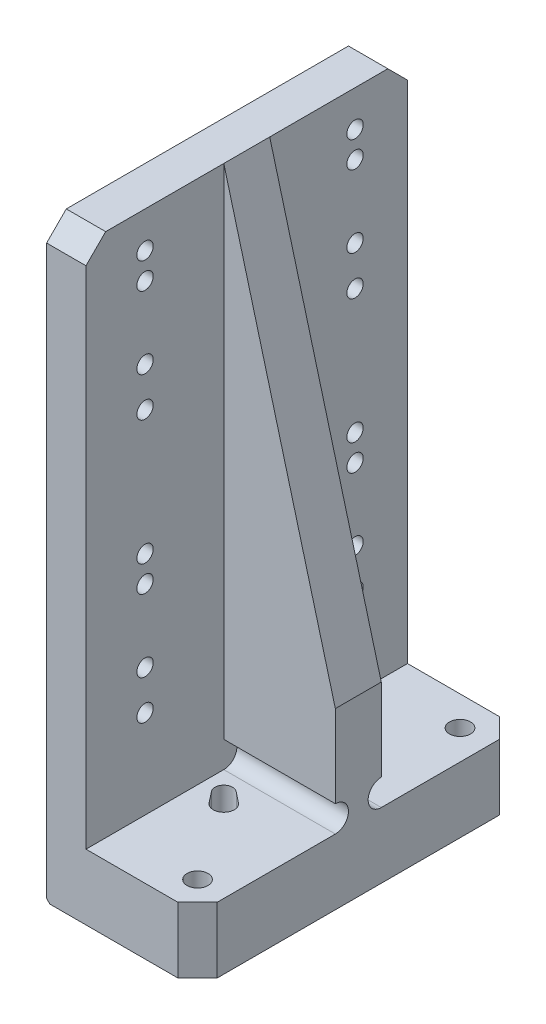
ISO-10303-21;
HEADER;
FILE_DESCRIPTION(('STEP AP214'),'2;1');
FILE_NAME('part.step','',(''),(''),'','','');
FILE_SCHEMA(('AUTOMOTIVE_DESIGN { 1 0 10303 214 1 1 1 1 }'));
ENDSEC;
DATA;
#1=APPLICATION_CONTEXT('core data for automotive mechanical design processes');
#2=APPLICATION_PROTOCOL_DEFINITION('international standard','automotive_design',2000,#1);
#3=PRODUCT_CONTEXT('',#1,'mechanical');
#4=PRODUCT('Part','Part','',(#3));
#5=PRODUCT_RELATED_PRODUCT_CATEGORY('part','',(#4));
#6=PRODUCT_DEFINITION_FORMATION('','',#4);
#7=PRODUCT_DEFINITION_CONTEXT('part definition',#1,'design');
#8=PRODUCT_DEFINITION('design','',#6,#7);
#9=PRODUCT_DEFINITION_SHAPE('','',#8);
#10=(LENGTH_UNIT() NAMED_UNIT(*) SI_UNIT(.MILLI.,.METRE.));
#11=(NAMED_UNIT(*) PLANE_ANGLE_UNIT() SI_UNIT($,.RADIAN.));
#12=(NAMED_UNIT(*) SI_UNIT($,.STERADIAN.) SOLID_ANGLE_UNIT());
#13=UNCERTAINTY_MEASURE_WITH_UNIT(LENGTH_MEASURE(1.E-05),#10,'distance_accuracy_value','');
#14=(GEOMETRIC_REPRESENTATION_CONTEXT(3) GLOBAL_UNCERTAINTY_ASSIGNED_CONTEXT((#13)) GLOBAL_UNIT_ASSIGNED_CONTEXT((#10,
#11,#12)) REPRESENTATION_CONTEXT('',''));
#15=CARTESIAN_POINT('',(0.,0.,0.));
#16=DIRECTION('',(0.,0.,1.));
#17=DIRECTION('',(1.,0.,0.));
#18=AXIS2_PLACEMENT_3D('',#15,#16,#17);
#19=CARTESIAN_POINT('',(6.,90.,-24.5));
#20=DIRECTION('',(1.,0.,0.));
#21=DIRECTION('',(0.,0.,-1.));
#22=AXIS2_PLACEMENT_3D('',#19,#20,#21);
#23=PLANE('',#22);
#24=CARTESIAN_POINT('',(6.,29.5,-16.5));
#25=DIRECTION('',(1.,0.,0.));
#26=DIRECTION('',(0.,0.,-1.));
#27=AXIS2_PLACEMENT_3D('',#24,#25,#26);
#28=CIRCLE('',#27,1.25);
#29=CARTESIAN_POINT('',(6.,29.5,-17.75));
#30=VERTEX_POINT('',#29);
#31=EDGE_CURVE('E513',#30,#30,#28,.F.);
#32=ORIENTED_EDGE('',*,*,#31,.T.);
#33=EDGE_LOOP('',(#32));
#34=FACE_BOUND('',#33,.T.);
#35=CARTESIAN_POINT('',(6.,84.5,-16.5));
#36=DIRECTION('',(1.,0.,0.));
#37=DIRECTION('',(0.,0.,-1.));
#38=AXIS2_PLACEMENT_3D('',#35,#36,#37);
#39=CIRCLE('',#38,1.25);
#40=CARTESIAN_POINT('',(6.,84.5,-17.75));
#41=VERTEX_POINT('',#40);
#42=EDGE_CURVE('E507',#41,#41,#39,.F.);
#43=ORIENTED_EDGE('',*,*,#42,.T.);
#44=EDGE_LOOP('',(#43));
#45=FACE_BOUND('',#44,.T.);
#46=CARTESIAN_POINT('',(6.,80.5,-16.5));
#47=DIRECTION('',(1.,0.,0.));
#48=DIRECTION('',(0.,0.,-1.));
#49=AXIS2_PLACEMENT_3D('',#46,#47,#48);
#50=CIRCLE('',#49,1.25);
#51=CARTESIAN_POINT('',(6.,80.5,-17.75));
#52=VERTEX_POINT('',#51);
#53=EDGE_CURVE('E483',#52,#52,#50,.F.);
#54=ORIENTED_EDGE('',*,*,#53,.T.);
#55=EDGE_LOOP('',(#54));
#56=FACE_BOUND('',#55,.T.);
#57=CARTESIAN_POINT('',(6.,40.5,-16.5));
#58=DIRECTION('',(1.,0.,0.));
#59=DIRECTION('',(0.,0.,-1.));
#60=AXIS2_PLACEMENT_3D('',#57,#58,#59);
#61=CIRCLE('',#60,1.24999999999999);
#62=CARTESIAN_POINT('',(6.,40.5,-17.75));
#63=VERTEX_POINT('',#62);
#64=EDGE_CURVE('E477',#63,#63,#61,.F.);
#65=ORIENTED_EDGE('',*,*,#64,.T.);
#66=EDGE_LOOP('',(#65));
#67=FACE_BOUND('',#66,.T.);
#68=CARTESIAN_POINT('',(6.,23.5,-16.5));
#69=DIRECTION('',(1.,0.,0.));
#70=DIRECTION('',(0.,0.,-1.));
#71=AXIS2_PLACEMENT_3D('',#68,#69,#70);
#72=CIRCLE('',#71,1.25);
#73=CARTESIAN_POINT('',(6.,23.5,-17.75));
#74=VERTEX_POINT('',#73);
#75=EDGE_CURVE('E474',#74,#74,#72,.F.);
#76=ORIENTED_EDGE('',*,*,#75,.T.);
#77=EDGE_LOOP('',(#76));
#78=FACE_BOUND('',#77,.T.);
#79=CARTESIAN_POINT('',(6.,63.5,-16.5));
#80=DIRECTION('',(1.,0.,0.));
#81=DIRECTION('',(0.,0.,-1.));
#82=AXIS2_PLACEMENT_3D('',#79,#80,#81);
#83=CIRCLE('',#82,1.25);
#84=CARTESIAN_POINT('',(6.,63.5,-17.75));
#85=VERTEX_POINT('',#84);
#86=EDGE_CURVE('E480',#85,#85,#83,.F.);
#87=ORIENTED_EDGE('',*,*,#86,.T.);
#88=EDGE_LOOP('',(#87));
#89=FACE_BOUND('',#88,.T.);
#90=CARTESIAN_POINT('',(6.,44.5,-16.5));
#91=DIRECTION('',(1.,0.,0.));
#92=DIRECTION('',(0.,0.,-1.));
#93=AXIS2_PLACEMENT_3D('',#90,#91,#92);
#94=CIRCLE('',#93,1.24999999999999);
#95=CARTESIAN_POINT('',(6.,44.5,-17.75));
#96=VERTEX_POINT('',#95);
#97=EDGE_CURVE('E498',#96,#96,#94,.F.);
#98=ORIENTED_EDGE('',*,*,#97,.T.);
#99=EDGE_LOOP('',(#98));
#100=FACE_BOUND('',#99,.T.);
#101=CARTESIAN_POINT('',(6.,69.5,-16.5));
#102=DIRECTION('',(1.,0.,0.));
#103=DIRECTION('',(0.,0.,-1.));
#104=AXIS2_PLACEMENT_3D('',#101,#102,#103);
#105=CIRCLE('',#104,1.25);
#106=CARTESIAN_POINT('',(6.,69.5,-17.75));
#107=VERTEX_POINT('',#106);
#108=EDGE_CURVE('E516',#107,#107,#105,.F.);
#109=ORIENTED_EDGE('',*,*,#108,.T.);
#110=EDGE_LOOP('',(#109));
#111=FACE_BOUND('',#110,.T.);
#112=DIRECTION('',(0.,0.,1.));
#113=VECTOR('',#112,1.);
#114=CARTESIAN_POINT('',(6.,90.,-24.5));
#115=LINE('',#114,#113);
#116=CARTESIAN_POINT('',(6.,90.,-21.5));
#117=VERTEX_POINT('',#116);
#118=CARTESIAN_POINT('',(6.,90.,-3.50000000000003));
#119=VERTEX_POINT('',#118);
#120=EDGE_CURVE('E457',#117,#119,#115,.T.);
#121=ORIENTED_EDGE('',*,*,#120,.T.);
#122=DIRECTION('',(0.,1.,0.));
#123=VECTOR('',#122,1.);
#124=CARTESIAN_POINT('',(6.,90.,-3.50000000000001));
#125=LINE('',#124,#123);
#126=CARTESIAN_POINT('',(6.00000000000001,14.,-3.50000000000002));
#127=VERTEX_POINT('',#126);
#128=EDGE_CURVE('E159',#127,#119,#125,.T.);
#129=ORIENTED_EDGE('',*,*,#128,.F.);
#130=CARTESIAN_POINT('',(6.,12.,-3.50000000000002));
#131=DIRECTION('',(-1.,0.,0.));
#132=DIRECTION('',(0.,0.,-1.));
#133=AXIS2_PLACEMENT_3D('',#130,#131,#132);
#134=CIRCLE('',#133,2.);
#135=CARTESIAN_POINT('',(6.,10.,-3.50000000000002));
#136=VERTEX_POINT('',#135);
#137=EDGE_CURVE('E379',#136,#127,#134,.T.);
#138=ORIENTED_EDGE('',*,*,#137,.F.);
#139=DIRECTION('',(0.,0.,-1.));
#140=VECTOR('',#139,1.);
#141=CARTESIAN_POINT('',(6.,9.99999999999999,24.5));
#142=LINE('',#141,#140);
#143=CARTESIAN_POINT('',(6.,10.,-24.5));
#144=VERTEX_POINT('',#143);
#145=EDGE_CURVE('E462',#136,#144,#142,.T.);
#146=ORIENTED_EDGE('',*,*,#145,.T.);
#147=DIRECTION('',(0.,1.,0.));
#148=VECTOR('',#147,1.);
#149=CARTESIAN_POINT('',(6.,90.,-24.5));
#150=LINE('',#149,#148);
#151=CARTESIAN_POINT('',(6.,87.,-24.5));
#152=VERTEX_POINT('',#151);
#153=EDGE_CURVE('E465',#144,#152,#150,.T.);
#154=ORIENTED_EDGE('',*,*,#153,.T.);
#155=DIRECTION('',(0.,-0.707106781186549,-0.707106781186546));
#156=VECTOR('',#155,1.);
#157=CARTESIAN_POINT('',(6.,88.5,-23.));
#158=LINE('',#157,#156);
#159=EDGE_CURVE('E679',#152,#117,#158,.F.);
#160=ORIENTED_EDGE('',*,*,#159,.T.);
#161=EDGE_LOOP('',(#121,#129,#138,#146,#154,#160));
#162=FACE_BOUND('',#161,.T.);
#163=ADVANCED_FACE('F144',(#34,#45,#56,#67,#78,#89,#100,#111,#162),#23,.T.);
#164=CARTESIAN_POINT('',(6.,69.5,15.5));
#165=DIRECTION('',(1.,0.,0.));
#166=DIRECTION('',(0.,0.,-1.));
#167=AXIS2_PLACEMENT_3D('',#164,#165,#166);
#168=CIRCLE('',#167,1.25);
#169=CARTESIAN_POINT('',(6.,69.5,14.25));
#170=VERTEX_POINT('',#169);
#171=EDGE_CURVE('E519',#170,#170,#168,.F.);
#172=ORIENTED_EDGE('',*,*,#171,.T.);
#173=EDGE_LOOP('',(#172));
#174=FACE_BOUND('',#173,.T.);
#175=CARTESIAN_POINT('',(6.,44.5,15.5));
#176=DIRECTION('',(1.,0.,0.));
#177=DIRECTION('',(0.,0.,-1.));
#178=AXIS2_PLACEMENT_3D('',#175,#176,#177);
#179=CIRCLE('',#178,1.24999999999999);
#180=CARTESIAN_POINT('',(6.,44.5,14.25));
#181=VERTEX_POINT('',#180);
#182=EDGE_CURVE('E501',#181,#181,#179,.F.);
#183=ORIENTED_EDGE('',*,*,#182,.T.);
#184=EDGE_LOOP('',(#183));
#185=FACE_BOUND('',#184,.T.);
#186=CARTESIAN_POINT('',(6.,80.5,15.5));
#187=DIRECTION('',(1.,0.,0.));
#188=DIRECTION('',(0.,0.,-1.));
#189=AXIS2_PLACEMENT_3D('',#186,#187,#188);
#190=CIRCLE('',#189,1.25);
#191=CARTESIAN_POINT('',(6.,80.5,14.25));
#192=VERTEX_POINT('',#191);
#193=EDGE_CURVE('E495',#192,#192,#190,.F.);
#194=ORIENTED_EDGE('',*,*,#193,.T.);
#195=EDGE_LOOP('',(#194));
#196=FACE_BOUND('',#195,.T.);
#197=CARTESIAN_POINT('',(6.,40.5,15.5));
#198=DIRECTION('',(1.,0.,0.));
#199=DIRECTION('',(0.,0.,-1.));
#200=AXIS2_PLACEMENT_3D('',#197,#198,#199);
#201=CIRCLE('',#200,1.24999999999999);
#202=CARTESIAN_POINT('',(6.,40.5,14.25));
#203=VERTEX_POINT('',#202);
#204=EDGE_CURVE('E489',#203,#203,#201,.F.);
#205=ORIENTED_EDGE('',*,*,#204,.T.);
#206=EDGE_LOOP('',(#205));
#207=FACE_BOUND('',#206,.T.);
#208=CARTESIAN_POINT('',(6.,23.5,15.5));
#209=DIRECTION('',(1.,0.,0.));
#210=DIRECTION('',(0.,0.,-1.));
#211=AXIS2_PLACEMENT_3D('',#208,#209,#210);
#212=CIRCLE('',#211,1.25);
#213=CARTESIAN_POINT('',(6.,23.5,14.25));
#214=VERTEX_POINT('',#213);
#215=EDGE_CURVE('E486',#214,#214,#212,.F.);
#216=ORIENTED_EDGE('',*,*,#215,.T.);
#217=EDGE_LOOP('',(#216));
#218=FACE_BOUND('',#217,.T.);
#219=CARTESIAN_POINT('',(6.,63.5,15.5));
#220=DIRECTION('',(1.,0.,0.));
#221=DIRECTION('',(0.,0.,-1.));
#222=AXIS2_PLACEMENT_3D('',#219,#220,#221);
#223=CIRCLE('',#222,1.25);
#224=CARTESIAN_POINT('',(6.,63.5,14.25));
#225=VERTEX_POINT('',#224);
#226=EDGE_CURVE('E492',#225,#225,#223,.F.);
#227=ORIENTED_EDGE('',*,*,#226,.T.);
#228=EDGE_LOOP('',(#227));
#229=FACE_BOUND('',#228,.T.);
#230=CARTESIAN_POINT('',(6.,84.5,15.5));
#231=DIRECTION('',(1.,0.,0.));
#232=DIRECTION('',(0.,0.,-1.));
#233=AXIS2_PLACEMENT_3D('',#230,#231,#232);
#234=CIRCLE('',#233,1.25);
#235=CARTESIAN_POINT('',(6.,84.5,14.25));
#236=VERTEX_POINT('',#235);
#237=EDGE_CURVE('E504',#236,#236,#234,.F.);
#238=ORIENTED_EDGE('',*,*,#237,.T.);
#239=EDGE_LOOP('',(#238));
#240=FACE_BOUND('',#239,.T.);
#241=CARTESIAN_POINT('',(6.,29.5,15.5));
#242=DIRECTION('',(1.,0.,0.));
#243=DIRECTION('',(0.,0.,-1.));
#244=AXIS2_PLACEMENT_3D('',#241,#242,#243);
#245=CIRCLE('',#244,1.25);
#246=CARTESIAN_POINT('',(6.,29.5,14.25));
#247=VERTEX_POINT('',#246);
#248=EDGE_CURVE('E510',#247,#247,#245,.F.);
#249=ORIENTED_EDGE('',*,*,#248,.T.);
#250=EDGE_LOOP('',(#249));
#251=FACE_BOUND('',#250,.T.);
#252=CARTESIAN_POINT('',(6.,9.99999999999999,24.5));
#253=VERTEX_POINT('',#252);
#254=CARTESIAN_POINT('',(6.,10.,3.5));
#255=VERTEX_POINT('',#254);
#256=EDGE_CURVE('E463',#253,#255,#142,.T.);
#257=ORIENTED_EDGE('',*,*,#256,.T.);
#258=CARTESIAN_POINT('',(6.,12.,3.5));
#259=DIRECTION('',(-1.,0.,0.));
#260=DIRECTION('',(0.,0.,-1.));
#261=AXIS2_PLACEMENT_3D('',#258,#259,#260);
#262=CIRCLE('',#261,2.);
#263=CARTESIAN_POINT('',(6.,14.,3.5));
#264=VERTEX_POINT('',#263);
#265=EDGE_CURVE('E167',#264,#255,#262,.T.);
#266=ORIENTED_EDGE('',*,*,#265,.F.);
#267=DIRECTION('',(0.,-1.,0.));
#268=VECTOR('',#267,1.);
#269=CARTESIAN_POINT('',(6.,90.,3.50000000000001));
#270=LINE('',#269,#268);
#271=CARTESIAN_POINT('',(6.,90.,3.5));
#272=VERTEX_POINT('',#271);
#273=EDGE_CURVE('E375',#272,#264,#270,.T.);
#274=ORIENTED_EDGE('',*,*,#273,.F.);
#275=CARTESIAN_POINT('',(6.,90.,21.5));
#276=VERTEX_POINT('',#275);
#277=EDGE_CURVE('E460',#272,#276,#115,.T.);
#278=ORIENTED_EDGE('',*,*,#277,.T.);
#279=DIRECTION('',(0.,0.707106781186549,-0.707106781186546));
#280=VECTOR('',#279,1.);
#281=CARTESIAN_POINT('',(6.,113.,-1.49999999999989));
#282=LINE('',#281,#280);
#283=CARTESIAN_POINT('',(6.,87.,24.5));
#284=VERTEX_POINT('',#283);
#285=EDGE_CURVE('E681',#276,#284,#282,.F.);
#286=ORIENTED_EDGE('',*,*,#285,.T.);
#287=DIRECTION('',(0.,-1.,0.));
#288=VECTOR('',#287,1.);
#289=CARTESIAN_POINT('',(6.,90.,24.5));
#290=LINE('',#289,#288);
#291=EDGE_CURVE('E459',#284,#253,#290,.T.);
#292=ORIENTED_EDGE('',*,*,#291,.T.);
#293=EDGE_LOOP('',(#257,#266,#274,#278,#286,#292));
#294=FACE_BOUND('',#293,.T.);
#295=ADVANCED_FACE('F724',(#174,#185,#196,#207,#218,#229,#240,#251,#294),#23,.T.);
#296=CARTESIAN_POINT('',(6.,9.99999999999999,24.5));
#297=DIRECTION('',(0.,-1.,0.));
#298=DIRECTION('',(0.,0.,-1.));
#299=AXIS2_PLACEMENT_3D('',#296,#297,#298);
#300=PLANE('',#299);
#301=CARTESIAN_POINT('',(9.,10.,-6.5));
#302=DIRECTION('',(0.,-1.,0.));
#303=DIRECTION('',(0.,0.,-1.));
#304=AXIS2_PLACEMENT_3D('',#301,#302,#303);
#305=CIRCLE('',#304,1.34999999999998);
#306=CARTESIAN_POINT('',(9.95459415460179,10.,-5.54540584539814));
#307=VERTEX_POINT('',#306);
#308=CARTESIAN_POINT('',(8.04540584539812,10.,-7.45459415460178));
#309=VERTEX_POINT('',#308);
#310=EDGE_CURVE('E431',#307,#309,#305,.T.);
#311=ORIENTED_EDGE('',*,*,#310,.T.);
#312=DIRECTION('',(-0.619486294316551,0.,0.785007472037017));
#313=VECTOR('',#312,1.);
#314=CARTESIAN_POINT('',(9.36862915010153,9.99999999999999,-9.13137084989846));
#315=LINE('',#314,#313);
#316=CARTESIAN_POINT('',(9.13661191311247,10.,-8.8373606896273));
#317=VERTEX_POINT('',#316);
#318=EDGE_CURVE('E389',#317,#309,#315,.T.);
#319=ORIENTED_EDGE('',*,*,#318,.F.);
#320=CARTESIAN_POINT('',(10.5,10.,-8.));
#321=DIRECTION('',(0.,-1.,0.));
#322=DIRECTION('',(0.,0.,-1.));
#323=AXIS2_PLACEMENT_3D('',#320,#321,#322);
#324=CIRCLE('',#323,1.59999999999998);
#325=CARTESIAN_POINT('',(11.3373606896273,10.,-6.63661191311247));
#326=VERTEX_POINT('',#325);
#327=EDGE_CURVE('E448',#317,#326,#324,.T.);
#328=ORIENTED_EDGE('',*,*,#327,.T.);
#329=DIRECTION('',(0.785007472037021,0.,-0.619486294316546));
#330=VECTOR('',#329,1.);
#331=CARTESIAN_POINT('',(9.95459415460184,9.99999999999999,-5.54540584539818));
#332=LINE('',#331,#330);
#333=EDGE_CURVE('E409',#307,#326,#332,.T.);
#334=ORIENTED_EDGE('',*,*,#333,.F.);
#335=EDGE_LOOP('',(#311,#319,#328,#334));
#336=FACE_BOUND('',#335,.T.);
#337=CARTESIAN_POINT('',(18.5,10.,-20.));
#338=DIRECTION('',(0.,-1.,0.));
#339=DIRECTION('',(0.,0.,-1.));
#340=AXIS2_PLACEMENT_3D('',#337,#338,#339);
#341=CIRCLE('',#340,1.59999999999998);
#342=CARTESIAN_POINT('',(18.5,10.,-21.6));
#343=VERTEX_POINT('',#342);
#344=EDGE_CURVE('E453',#343,#343,#341,.T.);
#345=ORIENTED_EDGE('',*,*,#344,.T.);
#346=EDGE_LOOP('',(#345));
#347=FACE_BOUND('',#346,.T.);
#348=DIRECTION('',(-1.,0.,0.));
#349=VECTOR('',#348,1.);
#350=CARTESIAN_POINT('',(103.305666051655,9.99999999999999,-3.5));
#351=LINE('',#350,#349);
#352=CARTESIAN_POINT('',(23.,9.99999999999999,-3.5));
#353=VERTEX_POINT('',#352);
#354=EDGE_CURVE('E385',#353,#136,#351,.T.);
#355=ORIENTED_EDGE('',*,*,#354,.F.);
#356=DIRECTION('',(0.,0.,-1.));
#357=VECTOR('',#356,1.);
#358=CARTESIAN_POINT('',(23.,9.99999999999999,24.5));
#359=LINE('',#358,#357);
#360=CARTESIAN_POINT('',(23.,10.,-21.5));
#361=VERTEX_POINT('',#360);
#362=EDGE_CURVE('E456',#353,#361,#359,.T.);
#363=ORIENTED_EDGE('',*,*,#362,.T.);
#364=DIRECTION('',(0.707106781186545,0.,0.70710678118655));
#365=VECTOR('',#364,1.);
#366=CARTESIAN_POINT('',(20.,9.99999999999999,-24.5));
#367=LINE('',#366,#365);
#368=CARTESIAN_POINT('',(20.,10.,-24.5));
#369=VERTEX_POINT('',#368);
#370=EDGE_CURVE('E667',#361,#369,#367,.F.);
#371=ORIENTED_EDGE('',*,*,#370,.T.);
#372=DIRECTION('',(1.,0.,0.));
#373=VECTOR('',#372,1.);
#374=CARTESIAN_POINT('',(6.,10.,-24.5));
#375=LINE('',#374,#373);
#376=EDGE_CURVE('E471',#144,#369,#375,.T.);
#377=ORIENTED_EDGE('',*,*,#376,.F.);
#378=ORIENTED_EDGE('',*,*,#145,.F.);
#379=EDGE_LOOP('',(#355,#363,#371,#377,#378));
#380=FACE_BOUND('',#379,.T.);
#381=ADVANCED_FACE('F758',(#336,#347,#380),#300,.F.);
#382=CARTESIAN_POINT('',(0.,90.,-24.5));
#383=DIRECTION('',(0.,-1.,0.));
#384=DIRECTION('',(0.,0.,-1.));
#385=AXIS2_PLACEMENT_3D('',#382,#383,#384);
#386=PLANE('',#385);
#387=ORIENTED_EDGE('',*,*,#277,.F.);
#388=DIRECTION('',(0.,0.,-1.));
#389=VECTOR('',#388,1.);
#390=CARTESIAN_POINT('',(6.,90.,24.5));
#391=LINE('',#390,#389);
#392=EDGE_CURVE('E351',#272,#119,#391,.T.);
#393=ORIENTED_EDGE('',*,*,#392,.T.);
#394=ORIENTED_EDGE('',*,*,#120,.F.);
#395=DIRECTION('',(-1.,0.,0.));
#396=VECTOR('',#395,1.);
#397=CARTESIAN_POINT('',(0.,90.,-21.5));
#398=LINE('',#397,#396);
#399=CARTESIAN_POINT('',(0.,90.,-21.5));
#400=VERTEX_POINT('',#399);
#401=EDGE_CURVE('E673',#117,#400,#398,.T.);
#402=ORIENTED_EDGE('',*,*,#401,.T.);
#403=DIRECTION('',(0.,0.,1.));
#404=VECTOR('',#403,1.);
#405=CARTESIAN_POINT('',(0.,90.,24.5));
#406=LINE('',#405,#404);
#407=CARTESIAN_POINT('',(0.,90.,21.5));
#408=VERTEX_POINT('',#407);
#409=EDGE_CURVE('E631',#400,#408,#406,.T.);
#410=ORIENTED_EDGE('',*,*,#409,.T.);
#411=DIRECTION('',(1.,0.,0.));
#412=VECTOR('',#411,1.);
#413=CARTESIAN_POINT('',(0.,90.,21.5));
#414=LINE('',#413,#412);
#415=EDGE_CURVE('E676',#408,#276,#414,.T.);
#416=ORIENTED_EDGE('',*,*,#415,.T.);
#417=EDGE_LOOP('',(#387,#393,#394,#402,#410,#416));
#418=FACE_BOUND('',#417,.T.);
#419=ADVANCED_FACE('F734',(#418),#386,.F.);
#420=CARTESIAN_POINT('',(0.,69.5,15.5));
#421=DIRECTION('',(-1.,0.,0.));
#422=DIRECTION('',(0.,0.,1.));
#423=AXIS2_PLACEMENT_3D('',#420,#421,#422);
#424=CYLINDRICAL_SURFACE('',#423,1.25);
#425=CARTESIAN_POINT('',(0.,69.5,15.5));
#426=DIRECTION('',(-1.,0.,0.));
#427=DIRECTION('',(0.,0.,1.));
#428=AXIS2_PLACEMENT_3D('',#425,#426,#427);
#429=CIRCLE('',#428,1.25);
#430=CARTESIAN_POINT('',(0.,69.5,16.75));
#431=VERTEX_POINT('',#430);
#432=EDGE_CURVE('E615',#431,#431,#429,.T.);
#433=ORIENTED_EDGE('',*,*,#432,.T.);
#434=EDGE_LOOP('',(#433));
#435=FACE_BOUND('',#434,.T.);
#436=ORIENTED_EDGE('',*,*,#171,.F.);
#437=EDGE_LOOP('',(#436));
#438=FACE_BOUND('',#437,.T.);
#439=ADVANCED_FACE('F891',(#435,#438),#424,.F.);
#440=CARTESIAN_POINT('',(0.,69.5,-16.5));
#441=DIRECTION('',(-1.,0.,0.));
#442=DIRECTION('',(0.,0.,1.));
#443=AXIS2_PLACEMENT_3D('',#440,#441,#442);
#444=CYLINDRICAL_SURFACE('',#443,1.25);
#445=CARTESIAN_POINT('',(0.,69.5,-16.5));
#446=DIRECTION('',(-1.,0.,0.));
#447=DIRECTION('',(0.,0.,1.));
#448=AXIS2_PLACEMENT_3D('',#445,#446,#447);
#449=CIRCLE('',#448,1.25);
#450=CARTESIAN_POINT('',(0.,69.5,-15.25));
#451=VERTEX_POINT('',#450);
#452=EDGE_CURVE('E612',#451,#451,#449,.T.);
#453=ORIENTED_EDGE('',*,*,#452,.T.);
#454=EDGE_LOOP('',(#453));
#455=FACE_BOUND('',#454,.T.);
#456=ORIENTED_EDGE('',*,*,#108,.F.);
#457=EDGE_LOOP('',(#456));
#458=FACE_BOUND('',#457,.T.);
#459=ADVANCED_FACE('F887',(#455,#458),#444,.F.);
#460=CARTESIAN_POINT('',(0.,29.5,-16.5));
#461=DIRECTION('',(-1.,0.,0.));
#462=DIRECTION('',(0.,0.,1.));
#463=AXIS2_PLACEMENT_3D('',#460,#461,#462);
#464=CYLINDRICAL_SURFACE('',#463,1.25);
#465=CARTESIAN_POINT('',(0.,29.5,-16.5));
#466=DIRECTION('',(-1.,0.,0.));
#467=DIRECTION('',(0.,0.,1.));
#468=AXIS2_PLACEMENT_3D('',#465,#466,#467);
#469=CIRCLE('',#468,1.25);
#470=CARTESIAN_POINT('',(0.,29.5,-15.25));
#471=VERTEX_POINT('',#470);
#472=EDGE_CURVE('E609',#471,#471,#469,.T.);
#473=ORIENTED_EDGE('',*,*,#472,.T.);
#474=EDGE_LOOP('',(#473));
#475=FACE_BOUND('',#474,.T.);
#476=ORIENTED_EDGE('',*,*,#31,.F.);
#477=EDGE_LOOP('',(#476));
#478=FACE_BOUND('',#477,.T.);
#479=ADVANCED_FACE('F883',(#475,#478),#464,.F.);
#480=CARTESIAN_POINT('',(0.,29.5,15.5));
#481=DIRECTION('',(-1.,0.,0.));
#482=DIRECTION('',(0.,0.,1.));
#483=AXIS2_PLACEMENT_3D('',#480,#481,#482);
#484=CYLINDRICAL_SURFACE('',#483,1.25);
#485=CARTESIAN_POINT('',(0.,29.5,15.5));
#486=DIRECTION('',(-1.,0.,0.));
#487=DIRECTION('',(0.,0.,1.));
#488=AXIS2_PLACEMENT_3D('',#485,#486,#487);
#489=CIRCLE('',#488,1.25);
#490=CARTESIAN_POINT('',(0.,29.5,16.75));
#491=VERTEX_POINT('',#490);
#492=EDGE_CURVE('E606',#491,#491,#489,.T.);
#493=ORIENTED_EDGE('',*,*,#492,.T.);
#494=EDGE_LOOP('',(#493));
#495=FACE_BOUND('',#494,.T.);
#496=ORIENTED_EDGE('',*,*,#248,.F.);
#497=EDGE_LOOP('',(#496));
#498=FACE_BOUND('',#497,.T.);
#499=ADVANCED_FACE('F879',(#495,#498),#484,.F.);
#500=CARTESIAN_POINT('',(0.,84.5,-16.5));
#501=DIRECTION('',(-1.,0.,0.));
#502=DIRECTION('',(0.,0.,1.));
#503=AXIS2_PLACEMENT_3D('',#500,#501,#502);
#504=CYLINDRICAL_SURFACE('',#503,1.25);
#505=CARTESIAN_POINT('',(0.,84.5,-16.5));
#506=DIRECTION('',(-1.,0.,0.));
#507=DIRECTION('',(0.,0.,1.));
#508=AXIS2_PLACEMENT_3D('',#505,#506,#507);
#509=CIRCLE('',#508,1.25);
#510=CARTESIAN_POINT('',(0.,84.5,-15.25));
#511=VERTEX_POINT('',#510);
#512=EDGE_CURVE('E603',#511,#511,#509,.T.);
#513=ORIENTED_EDGE('',*,*,#512,.T.);
#514=EDGE_LOOP('',(#513));
#515=FACE_BOUND('',#514,.T.);
#516=ORIENTED_EDGE('',*,*,#42,.F.);
#517=EDGE_LOOP('',(#516));
#518=FACE_BOUND('',#517,.T.);
#519=ADVANCED_FACE('F875',(#515,#518),#504,.F.);
#520=CARTESIAN_POINT('',(0.,84.5,15.5));
#521=DIRECTION('',(-1.,0.,0.));
#522=DIRECTION('',(0.,0.,1.));
#523=AXIS2_PLACEMENT_3D('',#520,#521,#522);
#524=CYLINDRICAL_SURFACE('',#523,1.25);
#525=CARTESIAN_POINT('',(0.,84.5,15.5));
#526=DIRECTION('',(-1.,0.,0.));
#527=DIRECTION('',(0.,0.,1.));
#528=AXIS2_PLACEMENT_3D('',#525,#526,#527);
#529=CIRCLE('',#528,1.25);
#530=CARTESIAN_POINT('',(0.,84.5,16.75));
#531=VERTEX_POINT('',#530);
#532=EDGE_CURVE('E600',#531,#531,#529,.T.);
#533=ORIENTED_EDGE('',*,*,#532,.T.);
#534=EDGE_LOOP('',(#533));
#535=FACE_BOUND('',#534,.T.);
#536=ORIENTED_EDGE('',*,*,#237,.F.);
#537=EDGE_LOOP('',(#536));
#538=FACE_BOUND('',#537,.T.);
#539=ADVANCED_FACE('F871',(#535,#538),#524,.F.);
#540=CARTESIAN_POINT('',(0.,44.5,15.5));
#541=DIRECTION('',(-1.,0.,0.));
#542=DIRECTION('',(0.,0.,1.));
#543=AXIS2_PLACEMENT_3D('',#540,#541,#542);
#544=CYLINDRICAL_SURFACE('',#543,1.24999999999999);
#545=CARTESIAN_POINT('',(0.,44.5,15.5));
#546=DIRECTION('',(-1.,0.,0.));
#547=DIRECTION('',(0.,0.,1.));
#548=AXIS2_PLACEMENT_3D('',#545,#546,#547);
#549=CIRCLE('',#548,1.24999999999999);
#550=CARTESIAN_POINT('',(0.,44.5,16.75));
#551=VERTEX_POINT('',#550);
#552=EDGE_CURVE('E597',#551,#551,#549,.T.);
#553=ORIENTED_EDGE('',*,*,#552,.T.);
#554=EDGE_LOOP('',(#553));
#555=FACE_BOUND('',#554,.T.);
#556=ORIENTED_EDGE('',*,*,#182,.F.);
#557=EDGE_LOOP('',(#556));
#558=FACE_BOUND('',#557,.T.);
#559=ADVANCED_FACE('F867',(#555,#558),#544,.F.);
#560=CARTESIAN_POINT('',(0.,44.5,-16.5));
#561=DIRECTION('',(-1.,0.,0.));
#562=DIRECTION('',(0.,0.,1.));
#563=AXIS2_PLACEMENT_3D('',#560,#561,#562);
#564=CYLINDRICAL_SURFACE('',#563,1.24999999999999);
#565=CARTESIAN_POINT('',(0.,44.5,-16.5));
#566=DIRECTION('',(-1.,0.,0.));
#567=DIRECTION('',(0.,0.,1.));
#568=AXIS2_PLACEMENT_3D('',#565,#566,#567);
#569=CIRCLE('',#568,1.24999999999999);
#570=CARTESIAN_POINT('',(0.,44.5,-15.25));
#571=VERTEX_POINT('',#570);
#572=EDGE_CURVE('E594',#571,#571,#569,.T.);
#573=ORIENTED_EDGE('',*,*,#572,.T.);
#574=EDGE_LOOP('',(#573));
#575=FACE_BOUND('',#574,.T.);
#576=ORIENTED_EDGE('',*,*,#97,.F.);
#577=EDGE_LOOP('',(#576));
#578=FACE_BOUND('',#577,.T.);
#579=ADVANCED_FACE('F863',(#575,#578),#564,.F.);
#580=CARTESIAN_POINT('',(0.,80.5,15.5));
#581=DIRECTION('',(-1.,0.,0.));
#582=DIRECTION('',(0.,0.,1.));
#583=AXIS2_PLACEMENT_3D('',#580,#581,#582);
#584=CYLINDRICAL_SURFACE('',#583,1.25);
#585=CARTESIAN_POINT('',(0.,80.5,15.5));
#586=DIRECTION('',(-1.,0.,0.));
#587=DIRECTION('',(0.,0.,1.));
#588=AXIS2_PLACEMENT_3D('',#585,#586,#587);
#589=CIRCLE('',#588,1.25);
#590=CARTESIAN_POINT('',(0.,80.5,16.75));
#591=VERTEX_POINT('',#590);
#592=EDGE_CURVE('E591',#591,#591,#589,.T.);
#593=ORIENTED_EDGE('',*,*,#592,.T.);
#594=EDGE_LOOP('',(#593));
#595=FACE_BOUND('',#594,.T.);
#596=ORIENTED_EDGE('',*,*,#193,.F.);
#597=EDGE_LOOP('',(#596));
#598=FACE_BOUND('',#597,.T.);
#599=ADVANCED_FACE('F859',(#595,#598),#584,.F.);
#600=CARTESIAN_POINT('',(0.,63.5,15.5));
#601=DIRECTION('',(-1.,0.,0.));
#602=DIRECTION('',(0.,0.,1.));
#603=AXIS2_PLACEMENT_3D('',#600,#601,#602);
#604=CYLINDRICAL_SURFACE('',#603,1.25);
#605=CARTESIAN_POINT('',(0.,63.5,15.5));
#606=DIRECTION('',(-1.,0.,0.));
#607=DIRECTION('',(0.,0.,1.));
#608=AXIS2_PLACEMENT_3D('',#605,#606,#607);
#609=CIRCLE('',#608,1.25);
#610=CARTESIAN_POINT('',(0.,63.5,16.75));
#611=VERTEX_POINT('',#610);
#612=EDGE_CURVE('E588',#611,#611,#609,.T.);
#613=ORIENTED_EDGE('',*,*,#612,.T.);
#614=EDGE_LOOP('',(#613));
#615=FACE_BOUND('',#614,.T.);
#616=ORIENTED_EDGE('',*,*,#226,.F.);
#617=EDGE_LOOP('',(#616));
#618=FACE_BOUND('',#617,.T.);
#619=ADVANCED_FACE('F855',(#615,#618),#604,.F.);
#620=CARTESIAN_POINT('',(0.,40.5,15.5));
#621=DIRECTION('',(-1.,0.,0.));
#622=DIRECTION('',(0.,0.,1.));
#623=AXIS2_PLACEMENT_3D('',#620,#621,#622);
#624=CYLINDRICAL_SURFACE('',#623,1.24999999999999);
#625=CARTESIAN_POINT('',(0.,40.5,15.5));
#626=DIRECTION('',(-1.,0.,0.));
#627=DIRECTION('',(0.,0.,1.));
#628=AXIS2_PLACEMENT_3D('',#625,#626,#627);
#629=CIRCLE('',#628,1.24999999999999);
#630=CARTESIAN_POINT('',(0.,40.5,16.75));
#631=VERTEX_POINT('',#630);
#632=EDGE_CURVE('E585',#631,#631,#629,.T.);
#633=ORIENTED_EDGE('',*,*,#632,.T.);
#634=EDGE_LOOP('',(#633));
#635=FACE_BOUND('',#634,.T.);
#636=ORIENTED_EDGE('',*,*,#204,.F.);
#637=EDGE_LOOP('',(#636));
#638=FACE_BOUND('',#637,.T.);
#639=ADVANCED_FACE('F851',(#635,#638),#624,.F.);
#640=CARTESIAN_POINT('',(0.,23.5,15.5));
#641=DIRECTION('',(-1.,0.,0.));
#642=DIRECTION('',(0.,0.,1.));
#643=AXIS2_PLACEMENT_3D('',#640,#641,#642);
#644=CYLINDRICAL_SURFACE('',#643,1.25);
#645=CARTESIAN_POINT('',(0.,23.5,15.5));
#646=DIRECTION('',(-1.,0.,0.));
#647=DIRECTION('',(0.,0.,1.));
#648=AXIS2_PLACEMENT_3D('',#645,#646,#647);
#649=CIRCLE('',#648,1.25);
#650=CARTESIAN_POINT('',(0.,23.5,16.75));
#651=VERTEX_POINT('',#650);
#652=EDGE_CURVE('E582',#651,#651,#649,.T.);
#653=ORIENTED_EDGE('',*,*,#652,.T.);
#654=EDGE_LOOP('',(#653));
#655=FACE_BOUND('',#654,.T.);
#656=ORIENTED_EDGE('',*,*,#215,.F.);
#657=EDGE_LOOP('',(#656));
#658=FACE_BOUND('',#657,.T.);
#659=ADVANCED_FACE('F847',(#655,#658),#644,.F.);
#660=CARTESIAN_POINT('',(0.,80.5,-16.5));
#661=DIRECTION('',(-1.,0.,0.));
#662=DIRECTION('',(0.,0.,1.));
#663=AXIS2_PLACEMENT_3D('',#660,#661,#662);
#664=CYLINDRICAL_SURFACE('',#663,1.25);
#665=CARTESIAN_POINT('',(0.,80.5,-16.5));
#666=DIRECTION('',(-1.,0.,0.));
#667=DIRECTION('',(0.,0.,1.));
#668=AXIS2_PLACEMENT_3D('',#665,#666,#667);
#669=CIRCLE('',#668,1.25);
#670=CARTESIAN_POINT('',(0.,80.5,-15.25));
#671=VERTEX_POINT('',#670);
#672=EDGE_CURVE('E579',#671,#671,#669,.T.);
#673=ORIENTED_EDGE('',*,*,#672,.T.);
#674=EDGE_LOOP('',(#673));
#675=FACE_BOUND('',#674,.T.);
#676=ORIENTED_EDGE('',*,*,#53,.F.);
#677=EDGE_LOOP('',(#676));
#678=FACE_BOUND('',#677,.T.);
#679=ADVANCED_FACE('F843',(#675,#678),#664,.F.);
#680=CARTESIAN_POINT('',(0.,63.5,-16.5));
#681=DIRECTION('',(-1.,0.,0.));
#682=DIRECTION('',(0.,0.,1.));
#683=AXIS2_PLACEMENT_3D('',#680,#681,#682);
#684=CYLINDRICAL_SURFACE('',#683,1.25);
#685=CARTESIAN_POINT('',(0.,63.5,-16.5));
#686=DIRECTION('',(-1.,0.,0.));
#687=DIRECTION('',(0.,0.,1.));
#688=AXIS2_PLACEMENT_3D('',#685,#686,#687);
#689=CIRCLE('',#688,1.25);
#690=CARTESIAN_POINT('',(0.,63.5,-15.25));
#691=VERTEX_POINT('',#690);
#692=EDGE_CURVE('E576',#691,#691,#689,.T.);
#693=ORIENTED_EDGE('',*,*,#692,.T.);
#694=EDGE_LOOP('',(#693));
#695=FACE_BOUND('',#694,.T.);
#696=ORIENTED_EDGE('',*,*,#86,.F.);
#697=EDGE_LOOP('',(#696));
#698=FACE_BOUND('',#697,.T.);
#699=ADVANCED_FACE('F839',(#695,#698),#684,.F.);
#700=CARTESIAN_POINT('',(0.,40.5,-16.5));
#701=DIRECTION('',(-1.,0.,0.));
#702=DIRECTION('',(0.,0.,1.));
#703=AXIS2_PLACEMENT_3D('',#700,#701,#702);
#704=CYLINDRICAL_SURFACE('',#703,1.24999999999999);
#705=CARTESIAN_POINT('',(0.,40.5,-16.5));
#706=DIRECTION('',(-1.,0.,0.));
#707=DIRECTION('',(0.,0.,1.));
#708=AXIS2_PLACEMENT_3D('',#705,#706,#707);
#709=CIRCLE('',#708,1.24999999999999);
#710=CARTESIAN_POINT('',(0.,40.5,-15.25));
#711=VERTEX_POINT('',#710);
#712=EDGE_CURVE('E573',#711,#711,#709,.T.);
#713=ORIENTED_EDGE('',*,*,#712,.T.);
#714=EDGE_LOOP('',(#713));
#715=FACE_BOUND('',#714,.T.);
#716=ORIENTED_EDGE('',*,*,#64,.F.);
#717=EDGE_LOOP('',(#716));
#718=FACE_BOUND('',#717,.T.);
#719=ADVANCED_FACE('F835',(#715,#718),#704,.F.);
#720=CARTESIAN_POINT('',(0.,23.5,-16.5));
#721=DIRECTION('',(-1.,0.,0.));
#722=DIRECTION('',(0.,0.,1.));
#723=AXIS2_PLACEMENT_3D('',#720,#721,#722);
#724=CYLINDRICAL_SURFACE('',#723,1.25);
#725=CARTESIAN_POINT('',(0.,23.5,-16.5));
#726=DIRECTION('',(-1.,0.,0.));
#727=DIRECTION('',(0.,0.,1.));
#728=AXIS2_PLACEMENT_3D('',#725,#726,#727);
#729=CIRCLE('',#728,1.25);
#730=CARTESIAN_POINT('',(0.,23.5,-15.25));
#731=VERTEX_POINT('',#730);
#732=EDGE_CURVE('E570',#731,#731,#729,.T.);
#733=ORIENTED_EDGE('',*,*,#732,.T.);
#734=EDGE_LOOP('',(#733));
#735=FACE_BOUND('',#734,.T.);
#736=ORIENTED_EDGE('',*,*,#75,.F.);
#737=EDGE_LOOP('',(#736));
#738=FACE_BOUND('',#737,.T.);
#739=ADVANCED_FACE('F832',(#735,#738),#724,.F.);
#740=CARTESIAN_POINT('',(0.,90.,24.5));
#741=DIRECTION('',(1.,0.,0.));
#742=DIRECTION('',(0.,0.,-1.));
#743=AXIS2_PLACEMENT_3D('',#740,#741,#742);
#744=PLANE('',#743);
#745=CARTESIAN_POINT('',(0.,40.5,-0.5));
#746=DIRECTION('',(-1.,0.,0.));
#747=DIRECTION('',(0.,0.,1.));
#748=AXIS2_PLACEMENT_3D('',#745,#746,#747);
#749=CIRCLE('',#748,0.749999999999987);
#750=CARTESIAN_POINT('',(0.,40.5,0.249999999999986));
#751=VERTEX_POINT('',#750);
#752=EDGE_CURVE('E522',#751,#751,#749,.T.);
#753=ORIENTED_EDGE('',*,*,#752,.F.);
#754=EDGE_LOOP('',(#753));
#755=FACE_BOUND('',#754,.T.);
#756=CARTESIAN_POINT('',(0.,80.5,-0.5));
#757=DIRECTION('',(-1.,0.,0.));
#758=DIRECTION('',(0.,0.,1.));
#759=AXIS2_PLACEMENT_3D('',#756,#757,#758);
#760=CIRCLE('',#759,0.749999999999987);
#761=CARTESIAN_POINT('',(0.,80.5,0.249999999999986));
#762=VERTEX_POINT('',#761);
#763=EDGE_CURVE('E528',#762,#762,#760,.T.);
#764=ORIENTED_EDGE('',*,*,#763,.F.);
#765=EDGE_LOOP('',(#764));
#766=FACE_BOUND('',#765,.T.);
#767=CARTESIAN_POINT('',(0.,23.5,-0.5));
#768=DIRECTION('',(-1.,0.,0.));
#769=DIRECTION('',(0.,0.,1.));
#770=AXIS2_PLACEMENT_3D('',#767,#768,#769);
#771=CIRCLE('',#770,0.749999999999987);
#772=CARTESIAN_POINT('',(0.,23.5,0.249999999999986));
#773=VERTEX_POINT('',#772);
#774=EDGE_CURVE('E534',#773,#773,#771,.T.);
#775=ORIENTED_EDGE('',*,*,#774,.F.);
#776=EDGE_LOOP('',(#775));
#777=FACE_BOUND('',#776,.T.);
#778=CARTESIAN_POINT('',(0.,63.5,-0.500000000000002));
#779=DIRECTION('',(-1.,0.,0.));
#780=DIRECTION('',(0.,0.,1.));
#781=AXIS2_PLACEMENT_3D('',#778,#779,#780);
#782=CIRCLE('',#781,0.749999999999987);
#783=CARTESIAN_POINT('',(0.,63.5,0.249999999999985));
#784=VERTEX_POINT('',#783);
#785=EDGE_CURVE('E540',#784,#784,#782,.T.);
#786=ORIENTED_EDGE('',*,*,#785,.F.);
#787=EDGE_LOOP('',(#786));
#788=FACE_BOUND('',#787,.T.);
#789=CARTESIAN_POINT('',(0.,84.5,-0.5));
#790=DIRECTION('',(-1.,0.,0.));
#791=DIRECTION('',(0.,0.,1.));
#792=AXIS2_PLACEMENT_3D('',#789,#790,#791);
#793=CIRCLE('',#792,0.749999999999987);
#794=CARTESIAN_POINT('',(0.,84.5,0.249999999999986));
#795=VERTEX_POINT('',#794);
#796=EDGE_CURVE('E546',#795,#795,#793,.T.);
#797=ORIENTED_EDGE('',*,*,#796,.F.);
#798=EDGE_LOOP('',(#797));
#799=FACE_BOUND('',#798,.T.);
#800=CARTESIAN_POINT('',(0.,69.5,-0.5));
#801=DIRECTION('',(-1.,0.,0.));
#802=DIRECTION('',(0.,0.,1.));
#803=AXIS2_PLACEMENT_3D('',#800,#801,#802);
#804=CIRCLE('',#803,0.749999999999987);
#805=CARTESIAN_POINT('',(0.,69.5,0.249999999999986));
#806=VERTEX_POINT('',#805);
#807=EDGE_CURVE('E552',#806,#806,#804,.T.);
#808=ORIENTED_EDGE('',*,*,#807,.F.);
#809=EDGE_LOOP('',(#808));
#810=FACE_BOUND('',#809,.T.);
#811=CARTESIAN_POINT('',(0.,44.5,-0.5));
#812=DIRECTION('',(-1.,0.,0.));
#813=DIRECTION('',(0.,0.,1.));
#814=AXIS2_PLACEMENT_3D('',#811,#812,#813);
#815=CIRCLE('',#814,0.749999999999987);
#816=CARTESIAN_POINT('',(0.,44.5,0.249999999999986));
#817=VERTEX_POINT('',#816);
#818=EDGE_CURVE('E558',#817,#817,#815,.T.);
#819=ORIENTED_EDGE('',*,*,#818,.F.);
#820=EDGE_LOOP('',(#819));
#821=FACE_BOUND('',#820,.T.);
#822=CARTESIAN_POINT('',(0.,29.5,-0.498921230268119));
#823=DIRECTION('',(-1.,0.,0.));
#824=DIRECTION('',(0.,0.,1.));
#825=AXIS2_PLACEMENT_3D('',#822,#823,#824);
#826=CIRCLE('',#825,0.749999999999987);
#827=CARTESIAN_POINT('',(0.,29.5,0.251078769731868));
#828=VERTEX_POINT('',#827);
#829=EDGE_CURVE('E564',#828,#828,#826,.T.);
#830=ORIENTED_EDGE('',*,*,#829,.F.);
#831=EDGE_LOOP('',(#830));
#832=FACE_BOUND('',#831,.T.);
#833=ORIENTED_EDGE('',*,*,#732,.F.);
#834=EDGE_LOOP('',(#833));
#835=FACE_BOUND('',#834,.T.);
#836=ORIENTED_EDGE('',*,*,#712,.F.);
#837=EDGE_LOOP('',(#836));
#838=FACE_BOUND('',#837,.T.);
#839=ORIENTED_EDGE('',*,*,#692,.F.);
#840=EDGE_LOOP('',(#839));
#841=FACE_BOUND('',#840,.T.);
#842=ORIENTED_EDGE('',*,*,#672,.F.);
#843=EDGE_LOOP('',(#842));
#844=FACE_BOUND('',#843,.T.);
#845=ORIENTED_EDGE('',*,*,#652,.F.);
#846=EDGE_LOOP('',(#845));
#847=FACE_BOUND('',#846,.T.);
#848=ORIENTED_EDGE('',*,*,#632,.F.);
#849=EDGE_LOOP('',(#848));
#850=FACE_BOUND('',#849,.T.);
#851=ORIENTED_EDGE('',*,*,#612,.F.);
#852=EDGE_LOOP('',(#851));
#853=FACE_BOUND('',#852,.T.);
#854=ORIENTED_EDGE('',*,*,#592,.F.);
#855=EDGE_LOOP('',(#854));
#856=FACE_BOUND('',#855,.T.);
#857=ORIENTED_EDGE('',*,*,#572,.F.);
#858=EDGE_LOOP('',(#857));
#859=FACE_BOUND('',#858,.T.);
#860=ORIENTED_EDGE('',*,*,#552,.F.);
#861=EDGE_LOOP('',(#860));
#862=FACE_BOUND('',#861,.T.);
#863=ORIENTED_EDGE('',*,*,#532,.F.);
#864=EDGE_LOOP('',(#863));
#865=FACE_BOUND('',#864,.T.);
#866=ORIENTED_EDGE('',*,*,#512,.F.);
#867=EDGE_LOOP('',(#866));
#868=FACE_BOUND('',#867,.T.);
#869=ORIENTED_EDGE('',*,*,#492,.F.);
#870=EDGE_LOOP('',(#869));
#871=FACE_BOUND('',#870,.T.);
#872=ORIENTED_EDGE('',*,*,#472,.F.);
#873=EDGE_LOOP('',(#872));
#874=FACE_BOUND('',#873,.T.);
#875=ORIENTED_EDGE('',*,*,#452,.F.);
#876=EDGE_LOOP('',(#875));
#877=FACE_BOUND('',#876,.T.);
#878=ORIENTED_EDGE('',*,*,#432,.F.);
#879=EDGE_LOOP('',(#878));
#880=FACE_BOUND('',#879,.T.);
#881=DIRECTION('',(0.,-1.,0.));
#882=VECTOR('',#881,1.);
#883=CARTESIAN_POINT('',(0.,90.,-24.5));
#884=LINE('',#883,#882);
#885=CARTESIAN_POINT('',(0.,87.,-24.5));
#886=VERTEX_POINT('',#885);
#887=CARTESIAN_POINT('',(0.,0.499999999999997,-24.5));
#888=VERTEX_POINT('',#887);
#889=EDGE_CURVE('E634',#886,#888,#884,.T.);
#890=ORIENTED_EDGE('',*,*,#889,.T.);
#891=DIRECTION('',(0.,0.,1.));
#892=VECTOR('',#891,1.);
#893=CARTESIAN_POINT('',(0.,0.499999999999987,24.5));
#894=LINE('',#893,#892);
#895=CARTESIAN_POINT('',(0.,0.499999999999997,24.5));
#896=VERTEX_POINT('',#895);
#897=EDGE_CURVE('E687',#888,#896,#894,.T.);
#898=ORIENTED_EDGE('',*,*,#897,.T.);
#899=DIRECTION('',(0.,-1.,0.));
#900=VECTOR('',#899,1.);
#901=CARTESIAN_POINT('',(0.,90.,24.5));
#902=LINE('',#901,#900);
#903=CARTESIAN_POINT('',(0.,87.,24.5));
#904=VERTEX_POINT('',#903);
#905=EDGE_CURVE('E644',#904,#896,#902,.T.);
#906=ORIENTED_EDGE('',*,*,#905,.F.);
#907=DIRECTION('',(0.,-0.707106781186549,0.707106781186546));
#908=VECTOR('',#907,1.);
#909=CARTESIAN_POINT('',(0.,90.,21.5));
#910=LINE('',#909,#908);
#911=EDGE_CURVE('E685',#904,#408,#910,.F.);
#912=ORIENTED_EDGE('',*,*,#911,.T.);
#913=ORIENTED_EDGE('',*,*,#409,.F.);
#914=DIRECTION('',(0.,0.707106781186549,0.707106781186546));
#915=VECTOR('',#914,1.);
#916=CARTESIAN_POINT('',(0.,90.,-21.5));
#917=LINE('',#916,#915);
#918=EDGE_CURVE('E683',#400,#886,#917,.F.);
#919=ORIENTED_EDGE('',*,*,#918,.T.);
#920=EDGE_LOOP('',(#890,#898,#906,#912,#913,#919));
#921=FACE_BOUND('',#920,.T.);
#922=ADVANCED_FACE('F703',(#755,#766,#777,#788,#799,#810,#821,#832,#835,#838,#841,#844,#847,
#850,#853,#856,#859,#862,#865,#868,#871,#874,#877,#880,#921),#744,.F.);
#923=CARTESIAN_POINT('',(0.,90.,24.5));
#924=DIRECTION('',(0.,0.,-1.));
#925=DIRECTION('',(-1.,0.,0.));
#926=AXIS2_PLACEMENT_3D('',#923,#924,#925);
#927=PLANE('',#926);
#928=ORIENTED_EDGE('',*,*,#905,.T.);
#929=DIRECTION('',(0.707106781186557,-0.707106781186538,0.));
#930=VECTOR('',#929,1.);
#931=CARTESIAN_POINT('',(0.,0.499999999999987,24.5));
#932=LINE('',#931,#930);
#933=CARTESIAN_POINT('',(0.5,0.,24.5));
#934=VERTEX_POINT('',#933);
#935=EDGE_CURVE('E690',#896,#934,#932,.T.);
#936=ORIENTED_EDGE('',*,*,#935,.T.);
#937=DIRECTION('',(1.,0.,0.));
#938=VECTOR('',#937,1.);
#939=CARTESIAN_POINT('',(0.,0.,24.5));
#940=LINE('',#939,#938);
#941=CARTESIAN_POINT('',(20.,0.,24.5));
#942=VERTEX_POINT('',#941);
#943=EDGE_CURVE('E630',#934,#942,#940,.T.);
#944=ORIENTED_EDGE('',*,*,#943,.T.);
#945=DIRECTION('',(0.,1.,0.));
#946=VECTOR('',#945,1.);
#947=CARTESIAN_POINT('',(20.,90.,24.5));
#948=LINE('',#947,#946);
#949=CARTESIAN_POINT('',(20.,9.99999999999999,24.5));
#950=VERTEX_POINT('',#949);
#951=EDGE_CURVE('E671',#942,#950,#948,.T.);
#952=ORIENTED_EDGE('',*,*,#951,.T.);
#953=DIRECTION('',(1.,0.,0.));
#954=VECTOR('',#953,1.);
#955=CARTESIAN_POINT('',(6.,9.99999999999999,24.5));
#956=LINE('',#955,#954);
#957=EDGE_CURVE('E468',#253,#950,#956,.T.);
#958=ORIENTED_EDGE('',*,*,#957,.F.);
#959=ORIENTED_EDGE('',*,*,#291,.F.);
#960=DIRECTION('',(-1.,0.,0.));
#961=VECTOR('',#960,1.);
#962=CARTESIAN_POINT('',(0.,87.,24.5));
#963=LINE('',#962,#961);
#964=EDGE_CURVE('E669',#284,#904,#963,.T.);
#965=ORIENTED_EDGE('',*,*,#964,.T.);
#966=EDGE_LOOP('',(#928,#936,#944,#952,#958,#959,#965));
#967=FACE_BOUND('',#966,.T.);
#968=ADVANCED_FACE('F708',(#967),#927,.F.);
#969=CARTESIAN_POINT('',(23.,90.,24.5));
#970=DIRECTION('',(-1.,0.,0.));
#971=DIRECTION('',(0.,0.,1.));
#972=AXIS2_PLACEMENT_3D('',#969,#970,#971);
#973=PLANE('',#972);
#974=DIRECTION('',(0.,-1.,0.));
#975=VECTOR('',#974,1.);
#976=CARTESIAN_POINT('',(23.,90.,-3.50000000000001));
#977=LINE('',#976,#975);
#978=CARTESIAN_POINT('',(23.,26.5551362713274,-3.50000000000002));
#979=VERTEX_POINT('',#978);
#980=CARTESIAN_POINT('',(23.,14.,-3.50000000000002));
#981=VERTEX_POINT('',#980);
#982=EDGE_CURVE('E355',#979,#981,#977,.T.);
#983=ORIENTED_EDGE('',*,*,#982,.F.);
#984=DIRECTION('',(0.,0.,-1.));
#985=VECTOR('',#984,1.);
#986=CARTESIAN_POINT('',(23.,26.5551362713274,24.5));
#987=LINE('',#986,#985);
#988=CARTESIAN_POINT('',(23.,26.5551362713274,3.50000000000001));
#989=VERTEX_POINT('',#988);
#990=EDGE_CURVE('E343',#989,#979,#987,.T.);
#991=ORIENTED_EDGE('',*,*,#990,.F.);
#992=DIRECTION('',(0.,1.,0.));
#993=VECTOR('',#992,1.);
#994=CARTESIAN_POINT('',(23.,90.,3.50000000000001));
#995=LINE('',#994,#993);
#996=CARTESIAN_POINT('',(23.,14.,3.5));
#997=VERTEX_POINT('',#996);
#998=EDGE_CURVE('E372',#997,#989,#995,.T.);
#999=ORIENTED_EDGE('',*,*,#998,.F.);
#1000=CARTESIAN_POINT('',(23.,12.,3.5));
#1001=DIRECTION('',(-1.,0.,0.));
#1002=DIRECTION('',(0.,0.,1.));
#1003=AXIS2_PLACEMENT_3D('',#1000,#1001,#1002);
#1004=CIRCLE('',#1003,2.);
#1005=CARTESIAN_POINT('',(23.,10.,3.5));
#1006=VERTEX_POINT('',#1005);
#1007=EDGE_CURVE('E364',#1006,#997,#1004,.F.);
#1008=ORIENTED_EDGE('',*,*,#1007,.F.);
#1009=CARTESIAN_POINT('',(23.,9.99999999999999,21.5));
#1010=VERTEX_POINT('',#1009);
#1011=EDGE_CURVE('E469',#1010,#1006,#359,.T.);
#1012=ORIENTED_EDGE('',*,*,#1011,.F.);
#1013=DIRECTION('',(0.,-1.,0.));
#1014=VECTOR('',#1013,1.);
#1015=CARTESIAN_POINT('',(23.,90.,21.5));
#1016=LINE('',#1015,#1014);
#1017=CARTESIAN_POINT('',(23.,0.,21.5));
#1018=VERTEX_POINT('',#1017);
#1019=EDGE_CURVE('E659',#1010,#1018,#1016,.T.);
#1020=ORIENTED_EDGE('',*,*,#1019,.T.);
#1021=DIRECTION('',(0.,0.,-1.));
#1022=VECTOR('',#1021,1.);
#1023=CARTESIAN_POINT('',(23.,0.,24.5));
#1024=LINE('',#1023,#1022);
#1025=CARTESIAN_POINT('',(23.,0.,-21.5));
#1026=VERTEX_POINT('',#1025);
#1027=EDGE_CURVE('E637',#1018,#1026,#1024,.T.);
#1028=ORIENTED_EDGE('',*,*,#1027,.T.);
#1029=DIRECTION('',(0.,1.,0.));
#1030=VECTOR('',#1029,1.);
#1031=CARTESIAN_POINT('',(23.,90.,-21.5));
#1032=LINE('',#1031,#1030);
#1033=EDGE_CURVE('E662',#1026,#361,#1032,.T.);
#1034=ORIENTED_EDGE('',*,*,#1033,.T.);
#1035=ORIENTED_EDGE('',*,*,#362,.F.);
#1036=CARTESIAN_POINT('',(23.,12.,-3.50000000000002));
#1037=DIRECTION('',(-1.,0.,0.));
#1038=DIRECTION('',(0.,0.,1.));
#1039=AXIS2_PLACEMENT_3D('',#1036,#1037,#1038);
#1040=CIRCLE('',#1039,2.);
#1041=EDGE_CURVE('E360',#981,#353,#1040,.F.);
#1042=ORIENTED_EDGE('',*,*,#1041,.F.);
#1043=EDGE_LOOP('',(#983,#991,#999,#1008,#1012,#1020,#1028,#1034,#1035,#1042));
#1044=FACE_BOUND('',#1043,.T.);
#1045=ADVANCED_FACE('F358',(#1044),#973,.F.);
#1046=CARTESIAN_POINT('',(0.,90.,-24.5));
#1047=DIRECTION('',(0.,0.,1.));
#1048=DIRECTION('',(1.,0.,0.));
#1049=AXIS2_PLACEMENT_3D('',#1046,#1047,#1048);
#1050=PLANE('',#1049);
#1051=DIRECTION('',(-1.,0.,0.));
#1052=VECTOR('',#1051,1.);
#1053=CARTESIAN_POINT('',(0.,0.,-24.5));
#1054=LINE('',#1053,#1052);
#1055=CARTESIAN_POINT('',(20.,0.,-24.5));
#1056=VERTEX_POINT('',#1055);
#1057=CARTESIAN_POINT('',(0.5,0.,-24.5));
#1058=VERTEX_POINT('',#1057);
#1059=EDGE_CURVE('E635',#1056,#1058,#1054,.T.);
#1060=ORIENTED_EDGE('',*,*,#1059,.T.);
#1061=DIRECTION('',(-0.707106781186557,0.707106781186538,0.));
#1062=VECTOR('',#1061,1.);
#1063=CARTESIAN_POINT('',(0.,0.499999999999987,-24.5));
#1064=LINE('',#1063,#1062);
#1065=EDGE_CURVE('E152',#1058,#888,#1064,.T.);
#1066=ORIENTED_EDGE('',*,*,#1065,.T.);
#1067=ORIENTED_EDGE('',*,*,#889,.F.);
#1068=DIRECTION('',(1.,0.,0.));
#1069=VECTOR('',#1068,1.);
#1070=CARTESIAN_POINT('',(0.,87.,-24.5));
#1071=LINE('',#1070,#1069);
#1072=EDGE_CURVE('E647',#886,#152,#1071,.T.);
#1073=ORIENTED_EDGE('',*,*,#1072,.T.);
#1074=ORIENTED_EDGE('',*,*,#153,.F.);
#1075=ORIENTED_EDGE('',*,*,#376,.T.);
#1076=DIRECTION('',(0.,-1.,0.));
#1077=VECTOR('',#1076,1.);
#1078=CARTESIAN_POINT('',(20.,90.,-24.5));
#1079=LINE('',#1078,#1077);
#1080=EDGE_CURVE('E651',#369,#1056,#1079,.T.);
#1081=ORIENTED_EDGE('',*,*,#1080,.T.);
#1082=EDGE_LOOP('',(#1060,#1066,#1067,#1073,#1074,#1075,#1081));
#1083=FACE_BOUND('',#1082,.T.);
#1084=ADVANCED_FACE('F696',(#1083),#1050,.F.);
#1085=CARTESIAN_POINT('',(0.,0.,-24.5));
#1086=DIRECTION('',(0.,-1.,0.));
#1087=DIRECTION('',(0.,0.,-1.));
#1088=AXIS2_PLACEMENT_3D('',#1085,#1086,#1087);
#1089=PLANE('',#1088);
#1090=DIRECTION('',(0.619486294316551,0.,-0.785007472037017));
#1091=VECTOR('',#1090,1.);
#1092=CARTESIAN_POINT('',(9.36862915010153,0.,-9.13137084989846));
#1093=LINE('',#1092,#1091);
#1094=CARTESIAN_POINT('',(8.04540584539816,0.,-7.45459415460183));
#1095=VERTEX_POINT('',#1094);
#1096=CARTESIAN_POINT('',(9.13661191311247,0.,-8.83736068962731));
#1097=VERTEX_POINT('',#1096);
#1098=EDGE_CURVE('E374',#1095,#1097,#1093,.T.);
#1099=ORIENTED_EDGE('',*,*,#1098,.F.);
#1100=CARTESIAN_POINT('',(9.,0.,-6.5));
#1101=DIRECTION('',(0.,-1.,0.));
#1102=DIRECTION('',(0.,0.,-1.));
#1103=AXIS2_PLACEMENT_3D('',#1100,#1101,#1102);
#1104=CIRCLE('',#1103,1.34999999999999);
#1105=CARTESIAN_POINT('',(9.9545941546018,0.,-5.54540584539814));
#1106=VERTEX_POINT('',#1105);
#1107=EDGE_CURVE('E428',#1106,#1095,#1104,.T.);
#1108=ORIENTED_EDGE('',*,*,#1107,.F.);
#1109=DIRECTION('',(-0.785007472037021,0.,0.619486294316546));
#1110=VECTOR('',#1109,1.);
#1111=CARTESIAN_POINT('',(9.95459415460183,0.,-5.54540584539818));
#1112=LINE('',#1111,#1110);
#1113=CARTESIAN_POINT('',(11.3373606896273,0.,-6.63661191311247));
#1114=VERTEX_POINT('',#1113);
#1115=EDGE_CURVE('E412',#1114,#1106,#1112,.T.);
#1116=ORIENTED_EDGE('',*,*,#1115,.F.);
#1117=CARTESIAN_POINT('',(10.5,0.,-8.));
#1118=DIRECTION('',(0.,-1.,0.));
#1119=DIRECTION('',(0.,0.,-1.));
#1120=AXIS2_PLACEMENT_3D('',#1117,#1118,#1119);
#1121=CIRCLE('',#1120,1.59999999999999);
#1122=EDGE_CURVE('E446',#1097,#1114,#1121,.T.);
#1123=ORIENTED_EDGE('',*,*,#1122,.F.);
#1124=EDGE_LOOP('',(#1099,#1108,#1116,#1123));
#1125=FACE_BOUND('',#1124,.T.);
#1126=DIRECTION('',(-0.619486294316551,0.,-0.785007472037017));
#1127=VECTOR('',#1126,1.);
#1128=CARTESIAN_POINT('',(9.36862915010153,0.,9.13137084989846));
#1129=LINE('',#1128,#1127);
#1130=CARTESIAN_POINT('',(9.13661191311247,0.,8.83736068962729));
#1131=VERTEX_POINT('',#1130);
#1132=CARTESIAN_POINT('',(8.04540584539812,0.,7.45459415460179));
#1133=VERTEX_POINT('',#1132);
#1134=EDGE_CURVE('E400',#1131,#1133,#1129,.T.);
#1135=ORIENTED_EDGE('',*,*,#1134,.F.);
#1136=CARTESIAN_POINT('',(10.5,0.,8.));
#1137=DIRECTION('',(0.,-1.,0.));
#1138=DIRECTION('',(0.,0.,-1.));
#1139=AXIS2_PLACEMENT_3D('',#1136,#1137,#1138);
#1140=CIRCLE('',#1139,1.59999999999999);
#1141=CARTESIAN_POINT('',(11.3373606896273,0.,6.63661191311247));
#1142=VERTEX_POINT('',#1141);
#1143=EDGE_CURVE('E440',#1142,#1131,#1140,.T.);
#1144=ORIENTED_EDGE('',*,*,#1143,.F.);
#1145=DIRECTION('',(0.785007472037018,0.,0.619486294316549));
#1146=VECTOR('',#1145,1.);
#1147=CARTESIAN_POINT('',(9.95459415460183,0.,5.54540584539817));
#1148=LINE('',#1147,#1146);
#1149=CARTESIAN_POINT('',(9.95459415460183,0.,5.54540584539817));
#1150=VERTEX_POINT('',#1149);
#1151=EDGE_CURVE('E422',#1150,#1142,#1148,.T.);
#1152=ORIENTED_EDGE('',*,*,#1151,.F.);
#1153=CARTESIAN_POINT('',(9.,0.,6.5));
#1154=DIRECTION('',(0.,-1.,0.));
#1155=DIRECTION('',(0.,0.,-1.));
#1156=AXIS2_PLACEMENT_3D('',#1153,#1154,#1155);
#1157=CIRCLE('',#1156,1.34999999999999);
#1158=EDGE_CURVE('E424',#1133,#1150,#1157,.T.);
#1159=ORIENTED_EDGE('',*,*,#1158,.F.);
#1160=EDGE_LOOP('',(#1135,#1144,#1152,#1159));
#1161=FACE_BOUND('',#1160,.T.);
#1162=CARTESIAN_POINT('',(18.5,0.,20.));
#1163=DIRECTION('',(0.,-1.,0.));
#1164=DIRECTION('',(0.,0.,-1.));
#1165=AXIS2_PLACEMENT_3D('',#1162,#1163,#1164);
#1166=CIRCLE('',#1165,1.59999999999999);
#1167=CARTESIAN_POINT('',(18.5,0.,18.4));
#1168=VERTEX_POINT('',#1167);
#1169=EDGE_CURVE('E434',#1168,#1168,#1166,.T.);
#1170=ORIENTED_EDGE('',*,*,#1169,.F.);
#1171=EDGE_LOOP('',(#1170));
#1172=FACE_BOUND('',#1171,.T.);
#1173=CARTESIAN_POINT('',(18.5,0.,-20.));
#1174=DIRECTION('',(0.,-1.,0.));
#1175=DIRECTION('',(0.,0.,-1.));
#1176=AXIS2_PLACEMENT_3D('',#1173,#1174,#1175);
#1177=CIRCLE('',#1176,1.59999999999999);
#1178=CARTESIAN_POINT('',(18.5,0.,-21.6));
#1179=VERTEX_POINT('',#1178);
#1180=EDGE_CURVE('E450',#1179,#1179,#1177,.T.);
#1181=ORIENTED_EDGE('',*,*,#1180,.F.);
#1182=EDGE_LOOP('',(#1181));
#1183=FACE_BOUND('',#1182,.T.);
#1184=CARTESIAN_POINT('',(2.5,0.,20.));
#1185=DIRECTION('',(0.,-1.,0.));
#1186=DIRECTION('',(0.,0.,-1.));
#1187=AXIS2_PLACEMENT_3D('',#1184,#1185,#1186);
#1188=CIRCLE('',#1187,0.749999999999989);
#1189=CARTESIAN_POINT('',(2.5,0.,19.25));
#1190=VERTEX_POINT('',#1189);
#1191=EDGE_CURVE('E621',#1190,#1190,#1188,.T.);
#1192=ORIENTED_EDGE('',*,*,#1191,.F.);
#1193=EDGE_LOOP('',(#1192));
#1194=FACE_BOUND('',#1193,.T.);
#1195=CARTESIAN_POINT('',(2.5,0.,-20.));
#1196=DIRECTION('',(0.,-1.,0.));
#1197=DIRECTION('',(0.,0.,-1.));
#1198=AXIS2_PLACEMENT_3D('',#1195,#1196,#1197);
#1199=CIRCLE('',#1198,0.749999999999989);
#1200=CARTESIAN_POINT('',(2.5,0.,-20.75));
#1201=VERTEX_POINT('',#1200);
#1202=EDGE_CURVE('E627',#1201,#1201,#1199,.T.);
#1203=ORIENTED_EDGE('',*,*,#1202,.F.);
#1204=EDGE_LOOP('',(#1203));
#1205=FACE_BOUND('',#1204,.T.);
#1206=ORIENTED_EDGE('',*,*,#943,.F.);
#1207=DIRECTION('',(0.,0.,-1.));
#1208=VECTOR('',#1207,1.);
#1209=CARTESIAN_POINT('',(0.5,0.,-24.5));
#1210=LINE('',#1209,#1208);
#1211=EDGE_CURVE('E692',#934,#1058,#1210,.T.);
#1212=ORIENTED_EDGE('',*,*,#1211,.T.);
#1213=ORIENTED_EDGE('',*,*,#1059,.F.);
#1214=DIRECTION('',(-0.707106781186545,0.,-0.70710678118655));
#1215=VECTOR('',#1214,1.);
#1216=CARTESIAN_POINT('',(10.0000000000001,0.,-34.5));
#1217=LINE('',#1216,#1215);
#1218=EDGE_CURVE('E657',#1056,#1026,#1217,.F.);
#1219=ORIENTED_EDGE('',*,*,#1218,.T.);
#1220=ORIENTED_EDGE('',*,*,#1027,.F.);
#1221=DIRECTION('',(0.70710678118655,0.,-0.707106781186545));
#1222=VECTOR('',#1221,1.);
#1223=CARTESIAN_POINT('',(34.5,0.,10.0000000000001));
#1224=LINE('',#1223,#1222);
#1225=EDGE_CURVE('E654',#1018,#942,#1224,.F.);
#1226=ORIENTED_EDGE('',*,*,#1225,.T.);
#1227=EDGE_LOOP('',(#1206,#1212,#1213,#1219,#1220,#1226));
#1228=FACE_BOUND('',#1227,.T.);
#1229=ADVANCED_FACE('F710',(#1125,#1161,#1172,#1183,#1194,#1205,#1228),#1089,.T.);
#1230=CARTESIAN_POINT('',(2.5,0.,-20.));
#1231=DIRECTION('',(0.,-1.,0.));
#1232=DIRECTION('',(0.,0.,-1.));
#1233=AXIS2_PLACEMENT_3D('',#1230,#1231,#1232);
#1234=CYLINDRICAL_SURFACE('',#1233,0.749999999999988);
#1235=CARTESIAN_POINT('',(2.5,3.5,-20.));
#1236=DIRECTION('',(0.,-1.,0.));
#1237=DIRECTION('',(0.,0.,-1.));
#1238=AXIS2_PLACEMENT_3D('',#1235,#1236,#1237);
#1239=CIRCLE('',#1238,0.749999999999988);
#1240=CARTESIAN_POINT('',(2.5,3.5,-20.75));
#1241=VERTEX_POINT('',#1240);
#1242=EDGE_CURVE('E624',#1241,#1241,#1239,.T.);
#1243=ORIENTED_EDGE('',*,*,#1242,.F.);
#1244=EDGE_LOOP('',(#1243));
#1245=FACE_BOUND('',#1244,.T.);
#1246=ORIENTED_EDGE('',*,*,#1202,.T.);
#1247=EDGE_LOOP('',(#1246));
#1248=FACE_BOUND('',#1247,.T.);
#1249=ADVANCED_FACE('F906',(#1245,#1248),#1234,.F.);
#1250=CARTESIAN_POINT('',(2.5,3.5,-20.));
#1251=DIRECTION('',(0.,-1.,0.));
#1252=DIRECTION('',(0.,0.,-1.));
#1253=AXIS2_PLACEMENT_3D('',#1250,#1251,#1252);
#1254=CONICAL_SURFACE('',#1253,0.749999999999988,1.02974425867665);
#1255=CARTESIAN_POINT('',(2.5,3.95064546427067,-20.));
#1256=VERTEX_POINT('',#1255);
#1257=VERTEX_LOOP('',#1256);
#1258=FACE_BOUND('',#1257,.T.);
#1259=ORIENTED_EDGE('',*,*,#1242,.T.);
#1260=EDGE_LOOP('',(#1259));
#1261=FACE_BOUND('',#1260,.T.);
#1262=ADVANCED_FACE('F902',(#1258,#1261),#1254,.F.);
#1263=CARTESIAN_POINT('',(2.5,0.,20.));
#1264=DIRECTION('',(0.,-1.,0.));
#1265=DIRECTION('',(0.,0.,-1.));
#1266=AXIS2_PLACEMENT_3D('',#1263,#1264,#1265);
#1267=CYLINDRICAL_SURFACE('',#1266,0.749999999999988);
#1268=CARTESIAN_POINT('',(2.5,3.5,20.));
#1269=DIRECTION('',(0.,-1.,0.));
#1270=DIRECTION('',(0.,0.,-1.));
#1271=AXIS2_PLACEMENT_3D('',#1268,#1269,#1270);
#1272=CIRCLE('',#1271,0.749999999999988);
#1273=CARTESIAN_POINT('',(2.5,3.5,19.25));
#1274=VERTEX_POINT('',#1273);
#1275=EDGE_CURVE('E618',#1274,#1274,#1272,.T.);
#1276=ORIENTED_EDGE('',*,*,#1275,.F.);
#1277=EDGE_LOOP('',(#1276));
#1278=FACE_BOUND('',#1277,.T.);
#1279=ORIENTED_EDGE('',*,*,#1191,.T.);
#1280=EDGE_LOOP('',(#1279));
#1281=FACE_BOUND('',#1280,.T.);
#1282=ADVANCED_FACE('F898',(#1278,#1281),#1267,.F.);
#1283=CARTESIAN_POINT('',(2.5,3.5,20.));
#1284=DIRECTION('',(0.,-1.,0.));
#1285=DIRECTION('',(0.,0.,-1.));
#1286=AXIS2_PLACEMENT_3D('',#1283,#1284,#1285);
#1287=CONICAL_SURFACE('',#1286,0.749999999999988,1.02974425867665);
#1288=CARTESIAN_POINT('',(2.5,3.95064546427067,20.));
#1289=VERTEX_POINT('',#1288);
#1290=VERTEX_LOOP('',#1289);
#1291=FACE_BOUND('',#1290,.T.);
#1292=ORIENTED_EDGE('',*,*,#1275,.T.);
#1293=EDGE_LOOP('',(#1292));
#1294=FACE_BOUND('',#1293,.T.);
#1295=ADVANCED_FACE('F830',(#1291,#1294),#1287,.F.);
#1296=CARTESIAN_POINT('',(3.5,29.5,-0.498921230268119));
#1297=DIRECTION('',(-1.,0.,0.));
#1298=DIRECTION('',(0.,0.,1.));
#1299=AXIS2_PLACEMENT_3D('',#1296,#1297,#1298);
#1300=CONICAL_SURFACE('',#1299,0.749999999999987,1.02974425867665);
#1301=CARTESIAN_POINT('',(3.95064546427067,29.5,-0.498921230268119));
#1302=VERTEX_POINT('',#1301);
#1303=VERTEX_LOOP('',#1302);
#1304=FACE_BOUND('',#1303,.T.);
#1305=CARTESIAN_POINT('',(3.5,29.5,-0.498921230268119));
#1306=DIRECTION('',(-1.,0.,0.));
#1307=DIRECTION('',(0.,0.,1.));
#1308=AXIS2_PLACEMENT_3D('',#1305,#1306,#1307);
#1309=CIRCLE('',#1308,0.749999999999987);
#1310=CARTESIAN_POINT('',(3.5,29.5,0.251078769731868));
#1311=VERTEX_POINT('',#1310);
#1312=EDGE_CURVE('E567',#1311,#1311,#1309,.T.);
#1313=ORIENTED_EDGE('',*,*,#1312,.T.);
#1314=EDGE_LOOP('',(#1313));
#1315=FACE_BOUND('',#1314,.T.);
#1316=ADVANCED_FACE('F826',(#1304,#1315),#1300,.F.);
#1317=CARTESIAN_POINT('',(0.,29.5,-0.498921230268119));
#1318=DIRECTION('',(-1.,0.,0.));
#1319=DIRECTION('',(0.,0.,1.));
#1320=AXIS2_PLACEMENT_3D('',#1317,#1318,#1319);
#1321=CYLINDRICAL_SURFACE('',#1320,0.749999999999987);
#1322=ORIENTED_EDGE('',*,*,#1312,.F.);
#1323=EDGE_LOOP('',(#1322));
#1324=FACE_BOUND('',#1323,.T.);
#1325=ORIENTED_EDGE('',*,*,#829,.T.);
#1326=EDGE_LOOP('',(#1325));
#1327=FACE_BOUND('',#1326,.T.);
#1328=ADVANCED_FACE('F822',(#1324,#1327),#1321,.F.);
#1329=CARTESIAN_POINT('',(3.5,44.5,-0.5));
#1330=DIRECTION('',(-1.,0.,0.));
#1331=DIRECTION('',(0.,0.,1.));
#1332=AXIS2_PLACEMENT_3D('',#1329,#1330,#1331);
#1333=CONICAL_SURFACE('',#1332,0.749999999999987,1.02974425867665);
#1334=CARTESIAN_POINT('',(3.95064546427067,44.5,-0.5));
#1335=VERTEX_POINT('',#1334);
#1336=VERTEX_LOOP('',#1335);
#1337=FACE_BOUND('',#1336,.T.);
#1338=CARTESIAN_POINT('',(3.5,44.5,-0.5));
#1339=DIRECTION('',(-1.,0.,0.));
#1340=DIRECTION('',(0.,0.,1.));
#1341=AXIS2_PLACEMENT_3D('',#1338,#1339,#1340);
#1342=CIRCLE('',#1341,0.749999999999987);
#1343=CARTESIAN_POINT('',(3.5,44.5,0.249999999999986));
#1344=VERTEX_POINT('',#1343);
#1345=EDGE_CURVE('E561',#1344,#1344,#1342,.T.);
#1346=ORIENTED_EDGE('',*,*,#1345,.T.);
#1347=EDGE_LOOP('',(#1346));
#1348=FACE_BOUND('',#1347,.T.);
#1349=ADVANCED_FACE('F818',(#1337,#1348),#1333,.F.);
#1350=CARTESIAN_POINT('',(0.,44.5,-0.5));
#1351=DIRECTION('',(-1.,0.,0.));
#1352=DIRECTION('',(0.,0.,1.));
#1353=AXIS2_PLACEMENT_3D('',#1350,#1351,#1352);
#1354=CYLINDRICAL_SURFACE('',#1353,0.749999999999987);
#1355=ORIENTED_EDGE('',*,*,#1345,.F.);
#1356=EDGE_LOOP('',(#1355));
#1357=FACE_BOUND('',#1356,.T.);
#1358=ORIENTED_EDGE('',*,*,#818,.T.);
#1359=EDGE_LOOP('',(#1358));
#1360=FACE_BOUND('',#1359,.T.);
#1361=ADVANCED_FACE('F814',(#1357,#1360),#1354,.F.);
#1362=CARTESIAN_POINT('',(3.5,69.5,-0.5));
#1363=DIRECTION('',(-1.,0.,0.));
#1364=DIRECTION('',(0.,0.,1.));
#1365=AXIS2_PLACEMENT_3D('',#1362,#1363,#1364);
#1366=CONICAL_SURFACE('',#1365,0.749999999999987,1.02974425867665);
#1367=CARTESIAN_POINT('',(3.95064546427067,69.5,-0.5));
#1368=VERTEX_POINT('',#1367);
#1369=VERTEX_LOOP('',#1368);
#1370=FACE_BOUND('',#1369,.T.);
#1371=CARTESIAN_POINT('',(3.5,69.5,-0.5));
#1372=DIRECTION('',(-1.,0.,0.));
#1373=DIRECTION('',(0.,0.,1.));
#1374=AXIS2_PLACEMENT_3D('',#1371,#1372,#1373);
#1375=CIRCLE('',#1374,0.749999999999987);
#1376=CARTESIAN_POINT('',(3.5,69.5,0.249999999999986));
#1377=VERTEX_POINT('',#1376);
#1378=EDGE_CURVE('E555',#1377,#1377,#1375,.T.);
#1379=ORIENTED_EDGE('',*,*,#1378,.T.);
#1380=EDGE_LOOP('',(#1379));
#1381=FACE_BOUND('',#1380,.T.);
#1382=ADVANCED_FACE('F810',(#1370,#1381),#1366,.F.);
#1383=CARTESIAN_POINT('',(0.,69.5,-0.5));
#1384=DIRECTION('',(-1.,0.,0.));
#1385=DIRECTION('',(0.,0.,1.));
#1386=AXIS2_PLACEMENT_3D('',#1383,#1384,#1385);
#1387=CYLINDRICAL_SURFACE('',#1386,0.749999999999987);
#1388=ORIENTED_EDGE('',*,*,#1378,.F.);
#1389=EDGE_LOOP('',(#1388));
#1390=FACE_BOUND('',#1389,.T.);
#1391=ORIENTED_EDGE('',*,*,#807,.T.);
#1392=EDGE_LOOP('',(#1391));
#1393=FACE_BOUND('',#1392,.T.);
#1394=ADVANCED_FACE('F806',(#1390,#1393),#1387,.F.);
#1395=CARTESIAN_POINT('',(3.5,84.5,-0.5));
#1396=DIRECTION('',(-1.,0.,0.));
#1397=DIRECTION('',(0.,0.,1.));
#1398=AXIS2_PLACEMENT_3D('',#1395,#1396,#1397);
#1399=CONICAL_SURFACE('',#1398,0.749999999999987,1.02974425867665);
#1400=CARTESIAN_POINT('',(3.95064546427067,84.5,-0.5));
#1401=VERTEX_POINT('',#1400);
#1402=VERTEX_LOOP('',#1401);
#1403=FACE_BOUND('',#1402,.T.);
#1404=CARTESIAN_POINT('',(3.5,84.5,-0.5));
#1405=DIRECTION('',(-1.,0.,0.));
#1406=DIRECTION('',(0.,0.,1.));
#1407=AXIS2_PLACEMENT_3D('',#1404,#1405,#1406);
#1408=CIRCLE('',#1407,0.749999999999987);
#1409=CARTESIAN_POINT('',(3.5,84.5,0.249999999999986));
#1410=VERTEX_POINT('',#1409);
#1411=EDGE_CURVE('E549',#1410,#1410,#1408,.T.);
#1412=ORIENTED_EDGE('',*,*,#1411,.T.);
#1413=EDGE_LOOP('',(#1412));
#1414=FACE_BOUND('',#1413,.T.);
#1415=ADVANCED_FACE('F802',(#1403,#1414),#1399,.F.);
#1416=CARTESIAN_POINT('',(0.,84.5,-0.5));
#1417=DIRECTION('',(-1.,0.,0.));
#1418=DIRECTION('',(0.,0.,1.));
#1419=AXIS2_PLACEMENT_3D('',#1416,#1417,#1418);
#1420=CYLINDRICAL_SURFACE('',#1419,0.749999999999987);
#1421=ORIENTED_EDGE('',*,*,#1411,.F.);
#1422=EDGE_LOOP('',(#1421));
#1423=FACE_BOUND('',#1422,.T.);
#1424=ORIENTED_EDGE('',*,*,#796,.T.);
#1425=EDGE_LOOP('',(#1424));
#1426=FACE_BOUND('',#1425,.T.);
#1427=ADVANCED_FACE('F798',(#1423,#1426),#1420,.F.);
#1428=CARTESIAN_POINT('',(3.5,63.5,-0.500000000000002));
#1429=DIRECTION('',(-1.,0.,0.));
#1430=DIRECTION('',(0.,0.,1.));
#1431=AXIS2_PLACEMENT_3D('',#1428,#1429,#1430);
#1432=CONICAL_SURFACE('',#1431,0.749999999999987,1.02974425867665);
#1433=CARTESIAN_POINT('',(3.95064546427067,63.5,-0.500000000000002));
#1434=VERTEX_POINT('',#1433);
#1435=VERTEX_LOOP('',#1434);
#1436=FACE_BOUND('',#1435,.T.);
#1437=CARTESIAN_POINT('',(3.5,63.5,-0.500000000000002));
#1438=DIRECTION('',(-1.,0.,0.));
#1439=DIRECTION('',(0.,0.,1.));
#1440=AXIS2_PLACEMENT_3D('',#1437,#1438,#1439);
#1441=CIRCLE('',#1440,0.749999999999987);
#1442=CARTESIAN_POINT('',(3.5,63.5,0.249999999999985));
#1443=VERTEX_POINT('',#1442);
#1444=EDGE_CURVE('E543',#1443,#1443,#1441,.T.);
#1445=ORIENTED_EDGE('',*,*,#1444,.T.);
#1446=EDGE_LOOP('',(#1445));
#1447=FACE_BOUND('',#1446,.T.);
#1448=ADVANCED_FACE('F794',(#1436,#1447),#1432,.F.);
#1449=CARTESIAN_POINT('',(0.,63.5,-0.500000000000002));
#1450=DIRECTION('',(-1.,0.,0.));
#1451=DIRECTION('',(0.,0.,1.));
#1452=AXIS2_PLACEMENT_3D('',#1449,#1450,#1451);
#1453=CYLINDRICAL_SURFACE('',#1452,0.749999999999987);
#1454=ORIENTED_EDGE('',*,*,#1444,.F.);
#1455=EDGE_LOOP('',(#1454));
#1456=FACE_BOUND('',#1455,.T.);
#1457=ORIENTED_EDGE('',*,*,#785,.T.);
#1458=EDGE_LOOP('',(#1457));
#1459=FACE_BOUND('',#1458,.T.);
#1460=ADVANCED_FACE('F790',(#1456,#1459),#1453,.F.);
#1461=CARTESIAN_POINT('',(3.5,23.5,-0.5));
#1462=DIRECTION('',(-1.,0.,0.));
#1463=DIRECTION('',(0.,0.,1.));
#1464=AXIS2_PLACEMENT_3D('',#1461,#1462,#1463);
#1465=CONICAL_SURFACE('',#1464,0.749999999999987,1.02974425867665);
#1466=CARTESIAN_POINT('',(3.95064546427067,23.5,-0.5));
#1467=VERTEX_POINT('',#1466);
#1468=VERTEX_LOOP('',#1467);
#1469=FACE_BOUND('',#1468,.T.);
#1470=CARTESIAN_POINT('',(3.5,23.5,-0.5));
#1471=DIRECTION('',(-1.,0.,0.));
#1472=DIRECTION('',(0.,0.,1.));
#1473=AXIS2_PLACEMENT_3D('',#1470,#1471,#1472);
#1474=CIRCLE('',#1473,0.749999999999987);
#1475=CARTESIAN_POINT('',(3.5,23.5,0.249999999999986));
#1476=VERTEX_POINT('',#1475);
#1477=EDGE_CURVE('E537',#1476,#1476,#1474,.T.);
#1478=ORIENTED_EDGE('',*,*,#1477,.T.);
#1479=EDGE_LOOP('',(#1478));
#1480=FACE_BOUND('',#1479,.T.);
#1481=ADVANCED_FACE('F786',(#1469,#1480),#1465,.F.);
#1482=CARTESIAN_POINT('',(0.,23.5,-0.5));
#1483=DIRECTION('',(-1.,0.,0.));
#1484=DIRECTION('',(0.,0.,1.));
#1485=AXIS2_PLACEMENT_3D('',#1482,#1483,#1484);
#1486=CYLINDRICAL_SURFACE('',#1485,0.749999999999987);
#1487=ORIENTED_EDGE('',*,*,#1477,.F.);
#1488=EDGE_LOOP('',(#1487));
#1489=FACE_BOUND('',#1488,.T.);
#1490=ORIENTED_EDGE('',*,*,#774,.T.);
#1491=EDGE_LOOP('',(#1490));
#1492=FACE_BOUND('',#1491,.T.);
#1493=ADVANCED_FACE('F782',(#1489,#1492),#1486,.F.);
#1494=CARTESIAN_POINT('',(3.5,80.5,-0.5));
#1495=DIRECTION('',(-1.,0.,0.));
#1496=DIRECTION('',(0.,0.,1.));
#1497=AXIS2_PLACEMENT_3D('',#1494,#1495,#1496);
#1498=CONICAL_SURFACE('',#1497,0.749999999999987,1.02974425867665);
#1499=CARTESIAN_POINT('',(3.95064546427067,80.5,-0.5));
#1500=VERTEX_POINT('',#1499);
#1501=VERTEX_LOOP('',#1500);
#1502=FACE_BOUND('',#1501,.T.);
#1503=CARTESIAN_POINT('',(3.5,80.5,-0.5));
#1504=DIRECTION('',(-1.,0.,0.));
#1505=DIRECTION('',(0.,0.,1.));
#1506=AXIS2_PLACEMENT_3D('',#1503,#1504,#1505);
#1507=CIRCLE('',#1506,0.749999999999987);
#1508=CARTESIAN_POINT('',(3.5,80.5,0.249999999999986));
#1509=VERTEX_POINT('',#1508);
#1510=EDGE_CURVE('E531',#1509,#1509,#1507,.T.);
#1511=ORIENTED_EDGE('',*,*,#1510,.T.);
#1512=EDGE_LOOP('',(#1511));
#1513=FACE_BOUND('',#1512,.T.);
#1514=ADVANCED_FACE('F778',(#1502,#1513),#1498,.F.);
#1515=CARTESIAN_POINT('',(0.,80.5,-0.5));
#1516=DIRECTION('',(-1.,0.,0.));
#1517=DIRECTION('',(0.,0.,1.));
#1518=AXIS2_PLACEMENT_3D('',#1515,#1516,#1517);
#1519=CYLINDRICAL_SURFACE('',#1518,0.749999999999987);
#1520=ORIENTED_EDGE('',*,*,#1510,.F.);
#1521=EDGE_LOOP('',(#1520));
#1522=FACE_BOUND('',#1521,.T.);
#1523=ORIENTED_EDGE('',*,*,#763,.T.);
#1524=EDGE_LOOP('',(#1523));
#1525=FACE_BOUND('',#1524,.T.);
#1526=ADVANCED_FACE('F774',(#1522,#1525),#1519,.F.);
#1527=CARTESIAN_POINT('',(3.5,40.5,-0.5));
#1528=DIRECTION('',(-1.,0.,0.));
#1529=DIRECTION('',(0.,0.,1.));
#1530=AXIS2_PLACEMENT_3D('',#1527,#1528,#1529);
#1531=CONICAL_SURFACE('',#1530,0.749999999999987,1.02974425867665);
#1532=CARTESIAN_POINT('',(3.95064546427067,40.5,-0.5));
#1533=VERTEX_POINT('',#1532);
#1534=VERTEX_LOOP('',#1533);
#1535=FACE_BOUND('',#1534,.T.);
#1536=CARTESIAN_POINT('',(3.5,40.5,-0.5));
#1537=DIRECTION('',(-1.,0.,0.));
#1538=DIRECTION('',(0.,0.,1.));
#1539=AXIS2_PLACEMENT_3D('',#1536,#1537,#1538);
#1540=CIRCLE('',#1539,0.749999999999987);
#1541=CARTESIAN_POINT('',(3.5,40.5,0.249999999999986));
#1542=VERTEX_POINT('',#1541);
#1543=EDGE_CURVE('E525',#1542,#1542,#1540,.T.);
#1544=ORIENTED_EDGE('',*,*,#1543,.T.);
#1545=EDGE_LOOP('',(#1544));
#1546=FACE_BOUND('',#1545,.T.);
#1547=ADVANCED_FACE('F770',(#1535,#1546),#1531,.F.);
#1548=CARTESIAN_POINT('',(0.,40.5,-0.5));
#1549=DIRECTION('',(-1.,0.,0.));
#1550=DIRECTION('',(0.,0.,1.));
#1551=AXIS2_PLACEMENT_3D('',#1548,#1549,#1550);
#1552=CYLINDRICAL_SURFACE('',#1551,0.749999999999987);
#1553=ORIENTED_EDGE('',*,*,#1543,.F.);
#1554=EDGE_LOOP('',(#1553));
#1555=FACE_BOUND('',#1554,.T.);
#1556=ORIENTED_EDGE('',*,*,#752,.T.);
#1557=EDGE_LOOP('',(#1556));
#1558=FACE_BOUND('',#1557,.T.);
#1559=ADVANCED_FACE('F766',(#1555,#1558),#1552,.F.);
#1560=CARTESIAN_POINT('',(18.5,9.99999999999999,20.));
#1561=DIRECTION('',(0.,-1.,0.));
#1562=DIRECTION('',(0.,0.,-1.));
#1563=AXIS2_PLACEMENT_3D('',#1560,#1561,#1562);
#1564=CIRCLE('',#1563,1.59999999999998);
#1565=CARTESIAN_POINT('',(18.5,9.99999999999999,18.4));
#1566=VERTEX_POINT('',#1565);
#1567=EDGE_CURVE('E437',#1566,#1566,#1564,.T.);
#1568=ORIENTED_EDGE('',*,*,#1567,.T.);
#1569=EDGE_LOOP('',(#1568));
#1570=FACE_BOUND('',#1569,.T.);
#1571=CARTESIAN_POINT('',(10.5,10.,8.));
#1572=DIRECTION('',(0.,-1.,0.));
#1573=DIRECTION('',(0.,0.,-1.));
#1574=AXIS2_PLACEMENT_3D('',#1571,#1572,#1573);
#1575=CIRCLE('',#1574,1.59999999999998);
#1576=CARTESIAN_POINT('',(11.3373606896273,10.,6.63661191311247));
#1577=VERTEX_POINT('',#1576);
#1578=CARTESIAN_POINT('',(9.13661191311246,10.,8.83736068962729));
#1579=VERTEX_POINT('',#1578);
#1580=EDGE_CURVE('E443',#1577,#1579,#1575,.T.);
#1581=ORIENTED_EDGE('',*,*,#1580,.T.);
#1582=DIRECTION('',(0.619486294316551,0.,0.785007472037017));
#1583=VECTOR('',#1582,1.);
#1584=CARTESIAN_POINT('',(9.36862915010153,9.99999999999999,9.13137084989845));
#1585=LINE('',#1584,#1583);
#1586=CARTESIAN_POINT('',(8.04540584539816,10.,7.45459415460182));
#1587=VERTEX_POINT('',#1586);
#1588=EDGE_CURVE('E397',#1587,#1579,#1585,.T.);
#1589=ORIENTED_EDGE('',*,*,#1588,.F.);
#1590=CARTESIAN_POINT('',(9.,10.,6.5));
#1591=DIRECTION('',(0.,-1.,0.));
#1592=DIRECTION('',(0.,0.,-1.));
#1593=AXIS2_PLACEMENT_3D('',#1590,#1591,#1592);
#1594=CIRCLE('',#1593,1.34999999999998);
#1595=CARTESIAN_POINT('',(9.95459415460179,10.,5.54540584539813));
#1596=VERTEX_POINT('',#1595);
#1597=EDGE_CURVE('E426',#1587,#1596,#1594,.T.);
#1598=ORIENTED_EDGE('',*,*,#1597,.T.);
#1599=DIRECTION('',(-0.785007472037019,0.,-0.619486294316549));
#1600=VECTOR('',#1599,1.);
#1601=CARTESIAN_POINT('',(9.95459415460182,9.99999999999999,5.54540584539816));
#1602=LINE('',#1601,#1600);
#1603=EDGE_CURVE('E419',#1577,#1596,#1602,.T.);
#1604=ORIENTED_EDGE('',*,*,#1603,.F.);
#1605=EDGE_LOOP('',(#1581,#1589,#1598,#1604));
#1606=FACE_BOUND('',#1605,.T.);
#1607=ORIENTED_EDGE('',*,*,#1011,.T.);
#1608=DIRECTION('',(-1.,0.,0.));
#1609=VECTOR('',#1608,1.);
#1610=CARTESIAN_POINT('',(103.305666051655,9.99999999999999,3.5));
#1611=LINE('',#1610,#1609);
#1612=EDGE_CURVE('E366',#1006,#255,#1611,.T.);
#1613=ORIENTED_EDGE('',*,*,#1612,.T.);
#1614=ORIENTED_EDGE('',*,*,#256,.F.);
#1615=ORIENTED_EDGE('',*,*,#957,.T.);
#1616=DIRECTION('',(-0.70710678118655,0.,0.707106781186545));
#1617=VECTOR('',#1616,1.);
#1618=CARTESIAN_POINT('',(23.,9.99999999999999,21.5));
#1619=LINE('',#1618,#1617);
#1620=EDGE_CURVE('E665',#950,#1010,#1619,.F.);
#1621=ORIENTED_EDGE('',*,*,#1620,.T.);
#1622=EDGE_LOOP('',(#1607,#1613,#1614,#1615,#1621));
#1623=FACE_BOUND('',#1622,.T.);
#1624=ADVANCED_FACE('F721',(#1570,#1606,#1623),#300,.F.);
#1625=CARTESIAN_POINT('',(20.,90.,-24.5));
#1626=DIRECTION('',(-0.70710678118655,0.,0.707106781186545));
#1627=DIRECTION('',(0.707106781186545,0.,0.70710678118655));
#1628=AXIS2_PLACEMENT_3D('',#1625,#1626,#1627);
#1629=PLANE('',#1628);
#1630=ORIENTED_EDGE('',*,*,#370,.F.);
#1631=ORIENTED_EDGE('',*,*,#1033,.F.);
#1632=ORIENTED_EDGE('',*,*,#1218,.F.);
#1633=ORIENTED_EDGE('',*,*,#1080,.F.);
#1634=EDGE_LOOP('',(#1630,#1631,#1632,#1633));
#1635=FACE_BOUND('',#1634,.T.);
#1636=ADVANCED_FACE('F750',(#1635),#1629,.F.);
#1637=CARTESIAN_POINT('',(23.,90.,21.5));
#1638=DIRECTION('',(-0.707106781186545,0.,-0.70710678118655));
#1639=DIRECTION('',(-0.70710678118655,0.,0.707106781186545));
#1640=AXIS2_PLACEMENT_3D('',#1637,#1638,#1639);
#1641=PLANE('',#1640);
#1642=ORIENTED_EDGE('',*,*,#1620,.F.);
#1643=ORIENTED_EDGE('',*,*,#951,.F.);
#1644=ORIENTED_EDGE('',*,*,#1225,.F.);
#1645=ORIENTED_EDGE('',*,*,#1019,.F.);
#1646=EDGE_LOOP('',(#1642,#1643,#1644,#1645));
#1647=FACE_BOUND('',#1646,.T.);
#1648=ADVANCED_FACE('F716',(#1647),#1641,.F.);
#1649=CARTESIAN_POINT('',(0.,90.,21.5));
#1650=DIRECTION('',(0.,-0.707106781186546,-0.707106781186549));
#1651=DIRECTION('',(0.,0.707106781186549,-0.707106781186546));
#1652=AXIS2_PLACEMENT_3D('',#1649,#1650,#1651);
#1653=PLANE('',#1652);
#1654=ORIENTED_EDGE('',*,*,#911,.F.);
#1655=ORIENTED_EDGE('',*,*,#964,.F.);
#1656=ORIENTED_EDGE('',*,*,#285,.F.);
#1657=ORIENTED_EDGE('',*,*,#415,.F.);
#1658=EDGE_LOOP('',(#1654,#1655,#1656,#1657));
#1659=FACE_BOUND('',#1658,.T.);
#1660=ADVANCED_FACE('F739',(#1659),#1653,.F.);
#1661=CARTESIAN_POINT('',(0.,90.,-21.5));
#1662=DIRECTION('',(0.,-0.707106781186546,0.707106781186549));
#1663=DIRECTION('',(0.,-0.707106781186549,-0.707106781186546));
#1664=AXIS2_PLACEMENT_3D('',#1661,#1662,#1663);
#1665=PLANE('',#1664);
#1666=ORIENTED_EDGE('',*,*,#159,.F.);
#1667=ORIENTED_EDGE('',*,*,#1072,.F.);
#1668=ORIENTED_EDGE('',*,*,#918,.F.);
#1669=ORIENTED_EDGE('',*,*,#401,.F.);
#1670=EDGE_LOOP('',(#1666,#1667,#1668,#1669));
#1671=FACE_BOUND('',#1670,.T.);
#1672=ADVANCED_FACE('F742',(#1671),#1665,.F.);
#1673=CARTESIAN_POINT('',(18.5,0.,-20.));
#1674=DIRECTION('',(0.,-1.,0.));
#1675=DIRECTION('',(0.,0.,-1.));
#1676=AXIS2_PLACEMENT_3D('',#1673,#1674,#1675);
#1677=CYLINDRICAL_SURFACE('',#1676,1.59999999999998);
#1678=ORIENTED_EDGE('',*,*,#1180,.T.);
#1679=EDGE_LOOP('',(#1678));
#1680=FACE_BOUND('',#1679,.T.);
#1681=ORIENTED_EDGE('',*,*,#344,.F.);
#1682=EDGE_LOOP('',(#1681));
#1683=FACE_BOUND('',#1682,.T.);
#1684=ADVANCED_FACE('F748',(#1680,#1683),#1677,.F.);
#1685=CARTESIAN_POINT('',(10.5,0.,-8.));
#1686=DIRECTION('',(0.,-1.,0.));
#1687=DIRECTION('',(0.,0.,-1.));
#1688=AXIS2_PLACEMENT_3D('',#1685,#1686,#1687);
#1689=CYLINDRICAL_SURFACE('',#1688,1.59999999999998);
#1690=ORIENTED_EDGE('',*,*,#327,.F.);
#1691=DIRECTION('',(0.,-1.,0.));
#1692=VECTOR('',#1691,1.);
#1693=CARTESIAN_POINT('',(9.13661191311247,0.,-8.8373606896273));
#1694=LINE('',#1693,#1692);
#1695=EDGE_CURVE('E391',#1097,#317,#1694,.F.);
#1696=ORIENTED_EDGE('',*,*,#1695,.F.);
#1697=ORIENTED_EDGE('',*,*,#1122,.T.);
#1698=DIRECTION('',(0.,-1.,0.));
#1699=VECTOR('',#1698,1.);
#1700=CARTESIAN_POINT('',(11.3373606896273,0.,-6.63661191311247));
#1701=LINE('',#1700,#1699);
#1702=EDGE_CURVE('E406',#326,#1114,#1701,.T.);
#1703=ORIENTED_EDGE('',*,*,#1702,.F.);
#1704=EDGE_LOOP('',(#1690,#1696,#1697,#1703));
#1705=FACE_BOUND('',#1704,.T.);
#1706=ADVANCED_FACE('F983',(#1705),#1689,.F.);
#1707=CARTESIAN_POINT('',(10.5,0.,8.));
#1708=DIRECTION('',(0.,-1.,0.));
#1709=DIRECTION('',(0.,0.,-1.));
#1710=AXIS2_PLACEMENT_3D('',#1707,#1708,#1709);
#1711=CYLINDRICAL_SURFACE('',#1710,1.59999999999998);
#1712=ORIENTED_EDGE('',*,*,#1143,.T.);
#1713=DIRECTION('',(0.,-1.,0.));
#1714=VECTOR('',#1713,1.);
#1715=CARTESIAN_POINT('',(9.13661191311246,0.,8.83736068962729));
#1716=LINE('',#1715,#1714);
#1717=EDGE_CURVE('E396',#1579,#1131,#1716,.T.);
#1718=ORIENTED_EDGE('',*,*,#1717,.F.);
#1719=ORIENTED_EDGE('',*,*,#1580,.F.);
#1720=DIRECTION('',(0.,-1.,0.));
#1721=VECTOR('',#1720,1.);
#1722=CARTESIAN_POINT('',(11.3373606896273,0.,6.63661191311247));
#1723=LINE('',#1722,#1721);
#1724=EDGE_CURVE('E417',#1142,#1577,#1723,.F.);
#1725=ORIENTED_EDGE('',*,*,#1724,.F.);
#1726=EDGE_LOOP('',(#1712,#1718,#1719,#1725));
#1727=FACE_BOUND('',#1726,.T.);
#1728=ADVANCED_FACE('F980',(#1727),#1711,.F.);
#1729=CARTESIAN_POINT('',(18.5,0.,20.));
#1730=DIRECTION('',(0.,-1.,0.));
#1731=DIRECTION('',(0.,0.,-1.));
#1732=AXIS2_PLACEMENT_3D('',#1729,#1730,#1731);
#1733=CYLINDRICAL_SURFACE('',#1732,1.59999999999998);
#1734=ORIENTED_EDGE('',*,*,#1169,.T.);
#1735=EDGE_LOOP('',(#1734));
#1736=FACE_BOUND('',#1735,.T.);
#1737=ORIENTED_EDGE('',*,*,#1567,.F.);
#1738=EDGE_LOOP('',(#1737));
#1739=FACE_BOUND('',#1738,.T.);
#1740=ADVANCED_FACE('F976',(#1736,#1739),#1733,.F.);
#1741=CARTESIAN_POINT('',(9.,0.,-6.5));
#1742=DIRECTION('',(0.,-1.,0.));
#1743=DIRECTION('',(0.,0.,-1.));
#1744=AXIS2_PLACEMENT_3D('',#1741,#1742,#1743);
#1745=CYLINDRICAL_SURFACE('',#1744,1.34999999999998);
#1746=ORIENTED_EDGE('',*,*,#1107,.T.);
#1747=DIRECTION('',(0.,-1.,0.));
#1748=VECTOR('',#1747,1.);
#1749=CARTESIAN_POINT('',(8.04540584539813,0.,-7.45459415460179));
#1750=LINE('',#1749,#1748);
#1751=EDGE_CURVE('E394',#309,#1095,#1750,.T.);
#1752=ORIENTED_EDGE('',*,*,#1751,.F.);
#1753=ORIENTED_EDGE('',*,*,#310,.F.);
#1754=DIRECTION('',(0.,-1.,0.));
#1755=VECTOR('',#1754,1.);
#1756=CARTESIAN_POINT('',(9.95459415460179,0.,-5.54540584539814));
#1757=LINE('',#1756,#1755);
#1758=EDGE_CURVE('E402',#1106,#307,#1757,.F.);
#1759=ORIENTED_EDGE('',*,*,#1758,.F.);
#1760=EDGE_LOOP('',(#1746,#1752,#1753,#1759));
#1761=FACE_BOUND('',#1760,.T.);
#1762=ADVANCED_FACE('F972',(#1761),#1745,.F.);
#1763=CARTESIAN_POINT('',(9.,0.,6.5));
#1764=DIRECTION('',(0.,-1.,0.));
#1765=DIRECTION('',(0.,0.,-1.));
#1766=AXIS2_PLACEMENT_3D('',#1763,#1764,#1765);
#1767=CYLINDRICAL_SURFACE('',#1766,1.34999999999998);
#1768=ORIENTED_EDGE('',*,*,#1597,.F.);
#1769=DIRECTION('',(0.,-1.,0.));
#1770=VECTOR('',#1769,1.);
#1771=CARTESIAN_POINT('',(8.04540584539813,0.,7.45459415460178));
#1772=LINE('',#1771,#1770);
#1773=EDGE_CURVE('E399',#1133,#1587,#1772,.F.);
#1774=ORIENTED_EDGE('',*,*,#1773,.F.);
#1775=ORIENTED_EDGE('',*,*,#1158,.T.);
#1776=DIRECTION('',(0.,-1.,0.));
#1777=VECTOR('',#1776,1.);
#1778=CARTESIAN_POINT('',(9.95459415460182,0.,5.54540584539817));
#1779=LINE('',#1778,#1777);
#1780=EDGE_CURVE('E414',#1596,#1150,#1779,.T.);
#1781=ORIENTED_EDGE('',*,*,#1780,.F.);
#1782=EDGE_LOOP('',(#1768,#1774,#1775,#1781));
#1783=FACE_BOUND('',#1782,.T.);
#1784=ADVANCED_FACE('F968',(#1783),#1767,.F.);
#1785=CARTESIAN_POINT('',(9.95459415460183,90.001,5.54540584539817));
#1786=DIRECTION('',(0.619486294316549,0.,-0.785007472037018));
#1787=DIRECTION('',(-0.785007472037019,0.,-0.619486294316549));
#1788=AXIS2_PLACEMENT_3D('',#1785,#1786,#1787);
#1789=PLANE('',#1788);
#1790=ORIENTED_EDGE('',*,*,#1603,.T.);
#1791=ORIENTED_EDGE('',*,*,#1780,.T.);
#1792=ORIENTED_EDGE('',*,*,#1151,.T.);
#1793=ORIENTED_EDGE('',*,*,#1724,.T.);
#1794=EDGE_LOOP('',(#1790,#1791,#1792,#1793));
#1795=FACE_BOUND('',#1794,.T.);
#1796=ADVANCED_FACE('F964',(#1795),#1789,.F.);
#1797=CARTESIAN_POINT('',(9.95459415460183,90.001,-5.54540584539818));
#1798=DIRECTION('',(0.619486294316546,0.,0.785007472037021));
#1799=DIRECTION('',(0.785007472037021,0.,-0.619486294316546));
#1800=AXIS2_PLACEMENT_3D('',#1797,#1798,#1799);
#1801=PLANE('',#1800);
#1802=ORIENTED_EDGE('',*,*,#333,.T.);
#1803=ORIENTED_EDGE('',*,*,#1702,.T.);
#1804=ORIENTED_EDGE('',*,*,#1115,.T.);
#1805=ORIENTED_EDGE('',*,*,#1758,.T.);
#1806=EDGE_LOOP('',(#1802,#1803,#1804,#1805));
#1807=FACE_BOUND('',#1806,.T.);
#1808=ADVANCED_FACE('F960',(#1807),#1801,.F.);
#1809=CARTESIAN_POINT('',(9.36862915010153,90.001,9.13137084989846));
#1810=DIRECTION('',(-0.785007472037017,0.,0.619486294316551));
#1811=DIRECTION('',(0.619486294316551,0.,0.785007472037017));
#1812=AXIS2_PLACEMENT_3D('',#1809,#1810,#1811);
#1813=PLANE('',#1812);
#1814=ORIENTED_EDGE('',*,*,#1588,.T.);
#1815=ORIENTED_EDGE('',*,*,#1717,.T.);
#1816=ORIENTED_EDGE('',*,*,#1134,.T.);
#1817=ORIENTED_EDGE('',*,*,#1773,.T.);
#1818=EDGE_LOOP('',(#1814,#1815,#1816,#1817));
#1819=FACE_BOUND('',#1818,.T.);
#1820=ADVANCED_FACE('F956',(#1819),#1813,.F.);
#1821=CARTESIAN_POINT('',(9.36862915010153,90.001,-9.13137084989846));
#1822=DIRECTION('',(-0.785007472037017,0.,-0.619486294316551));
#1823=DIRECTION('',(-0.619486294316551,0.,0.785007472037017));
#1824=AXIS2_PLACEMENT_3D('',#1821,#1822,#1823);
#1825=PLANE('',#1824);
#1826=ORIENTED_EDGE('',*,*,#318,.T.);
#1827=ORIENTED_EDGE('',*,*,#1751,.T.);
#1828=ORIENTED_EDGE('',*,*,#1098,.T.);
#1829=ORIENTED_EDGE('',*,*,#1695,.T.);
#1830=EDGE_LOOP('',(#1826,#1827,#1828,#1829));
#1831=FACE_BOUND('',#1830,.T.);
#1832=ADVANCED_FACE('F953',(#1831),#1825,.F.);
#1833=CARTESIAN_POINT('',(0.,0.499999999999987,24.5));
#1834=DIRECTION('',(-0.707106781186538,-0.707106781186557,0.));
#1835=DIRECTION('',(0.,0.,-1.));
#1836=AXIS2_PLACEMENT_3D('',#1833,#1834,#1835);
#1837=PLANE('',#1836);
#1838=ORIENTED_EDGE('',*,*,#1065,.F.);
#1839=ORIENTED_EDGE('',*,*,#1211,.F.);
#1840=ORIENTED_EDGE('',*,*,#935,.F.);
#1841=ORIENTED_EDGE('',*,*,#897,.F.);
#1842=EDGE_LOOP('',(#1838,#1839,#1840,#1841));
#1843=FACE_BOUND('',#1842,.T.);
#1844=ADVANCED_FACE('F146',(#1843),#1837,.T.);
#1845=CARTESIAN_POINT('',(103.305666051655,90.,-3.50000000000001));
#1846=DIRECTION('',(0.,0.,1.));
#1847=DIRECTION('',(0.,-1.,0.));
#1848=AXIS2_PLACEMENT_3D('',#1845,#1846,#1847);
#1849=PLANE('',#1848);
#1850=ORIENTED_EDGE('',*,*,#128,.T.);
#1851=DIRECTION('',(-0.258819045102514,0.96592582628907,0.));
#1852=VECTOR('',#1851,1.);
#1853=CARTESIAN_POINT('',(6.,90.,-3.50000000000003));
#1854=LINE('',#1853,#1852);
#1855=EDGE_CURVE('E346',#979,#119,#1854,.T.);
#1856=ORIENTED_EDGE('',*,*,#1855,.F.);
#1857=ORIENTED_EDGE('',*,*,#982,.T.);
#1858=DIRECTION('',(-1.,0.,0.));
#1859=VECTOR('',#1858,1.);
#1860=CARTESIAN_POINT('',(103.305666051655,14.,-3.50000000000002));
#1861=LINE('',#1860,#1859);
#1862=EDGE_CURVE('E383',#981,#127,#1861,.T.);
#1863=ORIENTED_EDGE('',*,*,#1862,.T.);
#1864=EDGE_LOOP('',(#1850,#1856,#1857,#1863));
#1865=FACE_BOUND('',#1864,.T.);
#1866=ADVANCED_FACE('F354',(#1865),#1849,.F.);
#1867=CARTESIAN_POINT('',(103.305666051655,12.,-3.50000000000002));
#1868=DIRECTION('',(-1.,0.,0.));
#1869=DIRECTION('',(0.,0.,1.));
#1870=AXIS2_PLACEMENT_3D('',#1867,#1868,#1869);
#1871=CYLINDRICAL_SURFACE('',#1870,2.);
#1872=ORIENTED_EDGE('',*,*,#1862,.F.);
#1873=ORIENTED_EDGE('',*,*,#1041,.T.);
#1874=ORIENTED_EDGE('',*,*,#354,.T.);
#1875=ORIENTED_EDGE('',*,*,#137,.T.);
#1876=EDGE_LOOP('',(#1872,#1873,#1874,#1875));
#1877=FACE_BOUND('',#1876,.T.);
#1878=ADVANCED_FACE('F940',(#1877),#1871,.F.);
#1879=CARTESIAN_POINT('',(103.305666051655,12.,3.5));
#1880=DIRECTION('',(-1.,0.,0.));
#1881=DIRECTION('',(0.,0.,1.));
#1882=AXIS2_PLACEMENT_3D('',#1879,#1880,#1881);
#1883=CYLINDRICAL_SURFACE('',#1882,2.);
#1884=ORIENTED_EDGE('',*,*,#1612,.F.);
#1885=ORIENTED_EDGE('',*,*,#1007,.T.);
#1886=DIRECTION('',(-1.,0.,0.));
#1887=VECTOR('',#1886,1.);
#1888=CARTESIAN_POINT('',(103.305666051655,14.,3.5));
#1889=LINE('',#1888,#1887);
#1890=EDGE_CURVE('E362',#997,#264,#1889,.T.);
#1891=ORIENTED_EDGE('',*,*,#1890,.T.);
#1892=ORIENTED_EDGE('',*,*,#265,.T.);
#1893=EDGE_LOOP('',(#1884,#1885,#1891,#1892));
#1894=FACE_BOUND('',#1893,.T.);
#1895=ADVANCED_FACE('F726',(#1894),#1883,.F.);
#1896=CARTESIAN_POINT('',(103.305666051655,90.,3.50000000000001));
#1897=DIRECTION('',(0.,0.,-1.));
#1898=DIRECTION('',(0.,1.,0.));
#1899=AXIS2_PLACEMENT_3D('',#1896,#1897,#1898);
#1900=PLANE('',#1899);
#1901=ORIENTED_EDGE('',*,*,#998,.T.);
#1902=DIRECTION('',(-0.258819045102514,0.96592582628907,0.));
#1903=VECTOR('',#1902,1.);
#1904=CARTESIAN_POINT('',(12.5182436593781,65.6735834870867,3.50000000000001));
#1905=LINE('',#1904,#1903);
#1906=EDGE_CURVE('E14',#989,#272,#1905,.T.);
#1907=ORIENTED_EDGE('',*,*,#1906,.T.);
#1908=ORIENTED_EDGE('',*,*,#273,.T.);
#1909=ORIENTED_EDGE('',*,*,#1890,.F.);
#1910=EDGE_LOOP('',(#1901,#1907,#1908,#1909));
#1911=FACE_BOUND('',#1910,.T.);
#1912=ADVANCED_FACE('F730',(#1911),#1900,.F.);
#1913=CARTESIAN_POINT('',(6.,90.,24.5));
#1914=DIRECTION('',(-0.96592582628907,-0.258819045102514,0.));
#1915=DIRECTION('',(0.258819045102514,-0.96592582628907,0.));
#1916=AXIS2_PLACEMENT_3D('',#1913,#1914,#1915);
#1917=PLANE('',#1916);
#1918=ORIENTED_EDGE('',*,*,#990,.T.);
#1919=ORIENTED_EDGE('',*,*,#1855,.T.);
#1920=ORIENTED_EDGE('',*,*,#392,.F.);
#1921=ORIENTED_EDGE('',*,*,#1906,.F.);
#1922=EDGE_LOOP('',(#1918,#1919,#1920,#1921));
#1923=FACE_BOUND('',#1922,.T.);
#1924=ADVANCED_FACE('F345',(#1923),#1917,.F.);
#1925=CLOSED_SHELL('',(#163,#295,#381,#419,#439,#459,#479,#499,#519,#539,#559,#579,#599,#619,
#639,#659,#679,#699,#719,#739,#922,#968,#1045,#1084,#1229,#1249,#1262,#1282,#1295,#1316,#1328,
#1349,#1361,#1382,#1394,#1415,#1427,#1448,#1460,#1481,#1493,#1514,#1526,#1547,#1559,#1624,#1636,
#1648,#1660,#1672,#1684,#1706,#1728,#1740,#1762,#1784,#1796,#1808,#1820,#1832,#1844,#1866,#1878,
#1895,#1912,#1924));
#1926=MANIFOLD_SOLID_BREP('B2',#1925);
#1927=ADVANCED_BREP_SHAPE_REPRESENTATION('',(#18,#1926),#14);
#1928=SHAPE_DEFINITION_REPRESENTATION(#9,#1927);
ENDSEC;
END-ISO-10303-21;
